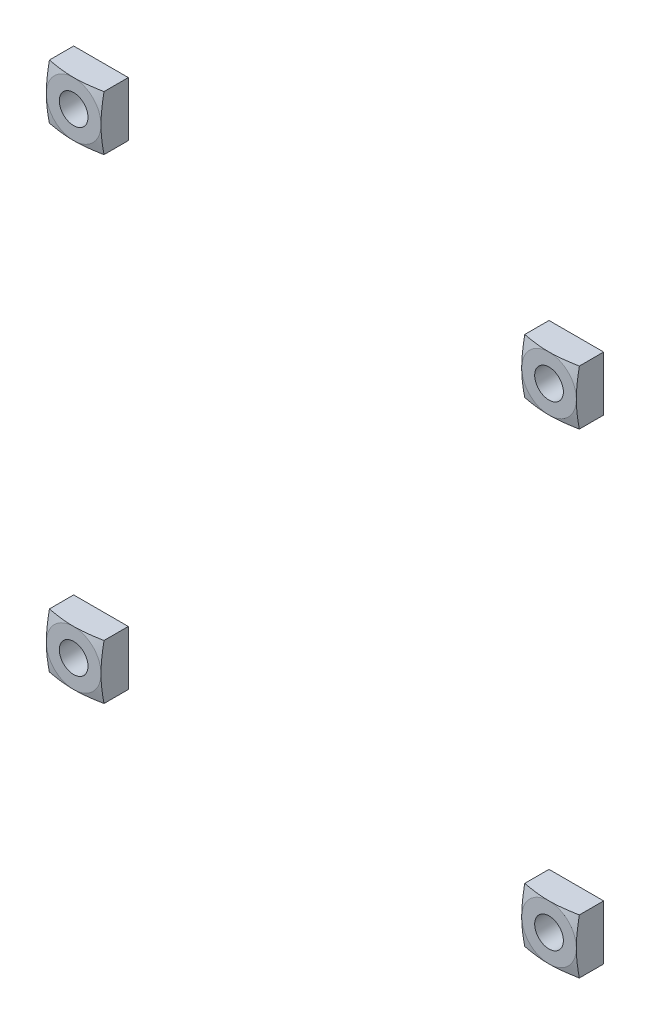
ISO-10303-21;
HEADER;
FILE_DESCRIPTION(('STEP AP214'),'2;1');
FILE_NAME('part.step','',(''),(''),'','','');
FILE_SCHEMA(('AUTOMOTIVE_DESIGN { 1 0 10303 214 1 1 1 1 }'));
ENDSEC;
DATA;
#1=APPLICATION_CONTEXT('core data for automotive mechanical design processes');
#2=APPLICATION_PROTOCOL_DEFINITION('international standard','automotive_design',2000,#1);
#3=PRODUCT_CONTEXT('',#1,'mechanical');
#4=PRODUCT('Part','Part','',(#3));
#5=PRODUCT_RELATED_PRODUCT_CATEGORY('part','',(#4));
#6=PRODUCT_DEFINITION_FORMATION('','',#4);
#7=PRODUCT_DEFINITION_CONTEXT('part definition',#1,'design');
#8=PRODUCT_DEFINITION('design','',#6,#7);
#9=PRODUCT_DEFINITION_SHAPE('','',#8);
#10=(LENGTH_UNIT() NAMED_UNIT(*) SI_UNIT(.MILLI.,.METRE.));
#11=(NAMED_UNIT(*) PLANE_ANGLE_UNIT() SI_UNIT($,.RADIAN.));
#12=(NAMED_UNIT(*) SI_UNIT($,.STERADIAN.) SOLID_ANGLE_UNIT());
#13=UNCERTAINTY_MEASURE_WITH_UNIT(LENGTH_MEASURE(1.E-05),#10,'distance_accuracy_value','');
#14=(GEOMETRIC_REPRESENTATION_CONTEXT(3) GLOBAL_UNCERTAINTY_ASSIGNED_CONTEXT((#13)) GLOBAL_UNIT_ASSIGNED_CONTEXT((#10,
#11,#12)) REPRESENTATION_CONTEXT('',''));
#15=CARTESIAN_POINT('',(0.,0.,0.));
#16=DIRECTION('',(0.,0.,1.));
#17=DIRECTION('',(1.,0.,0.));
#18=AXIS2_PLACEMENT_3D('',#15,#16,#17);
#19=CARTESIAN_POINT('',(-38.7984924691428,42.4307075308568,16.9672));
#20=DIRECTION('',(0.,-1.,0.));
#21=DIRECTION('',(1.,0.,0.));
#22=AXIS2_PLACEMENT_3D('',#19,#20,#21);
#23=PLANE('',#22);
#24=DIRECTION('',(0.,0.,1.));
#25=VECTOR('',#24,1.);
#26=CARTESIAN_POINT('',(-30.7984924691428,42.4307075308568,16.9672));
#27=LINE('',#26,#25);
#28=CARTESIAN_POINT('',(-30.7984924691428,42.4307075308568,16.9672));
#29=VERTEX_POINT('',#28);
#30=CARTESIAN_POINT('',(-30.7984924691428,42.4307075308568,20.5232472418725));
#31=VERTEX_POINT('',#30);
#32=EDGE_CURVE('P0_E153',#29,#31,#27,.T.);
#33=ORIENTED_EDGE('',*,*,#32,.T.);
#34=CARTESIAN_POINT('',(-42.8707092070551,42.4307075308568,19.6250632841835));
#35=CARTESIAN_POINT('',(-42.6623815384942,42.4307075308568,19.6750723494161));
#36=CARTESIAN_POINT('',(-42.4539699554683,42.4307075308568,19.7247354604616));
#37=CARTESIAN_POINT('',(-42.0369357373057,42.4307075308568,19.8231819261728));
#38=CARTESIAN_POINT('',(-41.8283130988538,42.4307075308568,19.8719652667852));
#39=CARTESIAN_POINT('',(-41.4108708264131,42.4307075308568,19.968451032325));
#40=CARTESIAN_POINT('',(-41.2020512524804,42.4307075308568,20.0161537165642));
#41=CARTESIAN_POINT('',(-40.7841132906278,42.4307075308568,20.1102317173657));
#42=CARTESIAN_POINT('',(-40.5749949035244,42.4307075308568,20.1566070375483));
#43=CARTESIAN_POINT('',(-40.1574835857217,42.4307075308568,20.2474599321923));
#44=CARTESIAN_POINT('',(-39.9490925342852,42.4307075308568,20.2919461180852));
#45=CARTESIAN_POINT('',(-39.5318784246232,42.4307075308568,20.3788421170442));
#46=CARTESIAN_POINT('',(-39.3230553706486,42.4307075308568,20.4212519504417));
#47=CARTESIAN_POINT('',(-38.9047594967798,42.4307075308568,20.5034540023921));
#48=CARTESIAN_POINT('',(-38.6952863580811,42.4307075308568,20.5432446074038));
#49=CARTESIAN_POINT('',(-38.2757191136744,42.4307075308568,20.6194398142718));
#50=CARTESIAN_POINT('',(-38.0656250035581,42.4307075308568,20.6558443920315));
#51=CARTESIAN_POINT('',(-37.6420838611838,42.4307075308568,20.7247518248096));
#52=CARTESIAN_POINT('',(-37.4286278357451,42.4307075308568,20.7571999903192));
#53=CARTESIAN_POINT('',(-37.0009230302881,42.4307075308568,20.8164547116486));
#54=CARTESIAN_POINT('',(-36.7866742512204,42.4307075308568,20.8432612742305));
#55=CARTESIAN_POINT('',(-36.3576823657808,42.4307075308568,20.8898500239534));
#56=CARTESIAN_POINT('',(-36.1429402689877,42.4307075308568,20.9096413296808));
#57=CARTESIAN_POINT('',(-35.7128484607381,42.4307075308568,20.9409514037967));
#58=CARTESIAN_POINT('',(-35.4974987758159,42.4307075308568,20.9524705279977));
#59=CARTESIAN_POINT('',(-35.0656219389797,42.4307075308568,20.9663542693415));
#60=CARTESIAN_POINT('',(-34.8490935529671,42.4307075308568,20.9686815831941));
#61=CARTESIAN_POINT('',(-34.4161434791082,42.4307075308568,20.9638761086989));
#62=CARTESIAN_POINT('',(-34.1997217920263,42.4307075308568,20.9567432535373));
#63=CARTESIAN_POINT('',(-33.7671012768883,42.4307075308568,20.9336058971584));
#64=CARTESIAN_POINT('',(-33.5509030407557,42.4307075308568,20.9175906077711));
#65=CARTESIAN_POINT('',(-33.1192313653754,42.4307075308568,20.8778523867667));
#66=CARTESIAN_POINT('',(-32.9037579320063,42.4307075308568,20.8541293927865));
#67=CARTESIAN_POINT('',(-32.3783678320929,42.4307075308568,20.7884609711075));
#68=CARTESIAN_POINT('',(-32.0688831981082,42.4307075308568,20.7430981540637));
#69=CARTESIAN_POINT('',(-31.4514114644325,42.4307075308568,20.6430238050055));
#70=CARTESIAN_POINT('',(-31.1434246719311,42.4307075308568,20.5883104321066));
#71=CARTESIAN_POINT('',(-30.5284950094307,42.4307075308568,20.4723484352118));
#72=CARTESIAN_POINT('',(-30.2215529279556,42.4307075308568,20.4110956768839));
#73=CARTESIAN_POINT('',(-29.6086441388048,42.4307075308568,20.2840443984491));
#74=CARTESIAN_POINT('',(-29.3026773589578,42.4307075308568,20.2182462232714));
#75=CARTESIAN_POINT('',(-28.6907794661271,42.4307075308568,20.0832616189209));
#76=CARTESIAN_POINT('',(-28.384849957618,42.4307075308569,20.0140679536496));
#77=CARTESIAN_POINT('',(-27.7735325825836,42.4307075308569,19.8733164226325));
#78=CARTESIAN_POINT('',(-27.4681447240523,42.4307075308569,19.8017585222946));
#79=CARTESIAN_POINT('',(-26.8579038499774,42.4307075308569,19.656916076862));
#80=CARTESIAN_POINT('',(-26.5530506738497,42.4307075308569,19.5836322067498));
#81=CARTESIAN_POINT('',(-25.9436676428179,42.4307075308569,19.4357309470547));
#82=CARTESIAN_POINT('',(-25.6391377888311,42.4307075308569,19.3611135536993));
#83=CARTESIAN_POINT('',(-24.7299459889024,42.4307075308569,19.1367260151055));
#84=CARTESIAN_POINT('',(-24.125654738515,42.4307075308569,18.9854550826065));
#85=CARTESIAN_POINT('',(-22.917638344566,42.4307075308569,18.6803792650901));
#86=CARTESIAN_POINT('',(-22.3139132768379,42.4307075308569,18.5265740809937));
#87=CARTESIAN_POINT('',(-21.109749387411,42.4307075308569,18.2180127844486));
#88=CARTESIAN_POINT('',(-20.5093085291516,42.4307075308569,18.0632646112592));
#89=CARTESIAN_POINT('',(-19.3088144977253,42.4307075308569,17.7525877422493));
#90=CARTESIAN_POINT('',(-18.7087612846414,42.4307075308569,17.5966592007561));
#91=CARTESIAN_POINT('',(-18.1088048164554,42.4307075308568,17.4403635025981));
#92=B_SPLINE_CURVE_WITH_KNOTS('',3,(#34,#35,#36,#37,#38,#39,#40,#41,#42,#43,#44,#45,#46,#47,#48,
#49,#50,#51,#52,#53,#54,#55,#56,#57,#58,#59,#60,#61,#62,#63,#64,#65,#66,#67,#68,#69,#70,#71,#72,
#73,#74,#75,#76,#77,#78,#79,#80,#81,#82,#83,#84,#85,#86,#87,#88,#89,#90,#91),.UNSPECIFIED.,.F.,
.F.,(4,2,2,2,2,2,2,2,2,2,2,2,2,2,2,2,2,2,2,2,2,2,2,2,2,2,2,2,4),(0.,0.642738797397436,
1.2854878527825,1.92808100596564,2.57067240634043,3.20992362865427,3.84916859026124,
4.4888037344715,5.12844343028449,5.77610915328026,6.42377409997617,7.07059408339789,
7.71738624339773,8.36680061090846,9.01621956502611,9.66642900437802,10.3166437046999,
11.254795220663,12.1931316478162,13.1320648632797,14.0709269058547,15.0118848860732,
15.9528566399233,16.8934663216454,17.8340786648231,19.7028801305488,21.5719037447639,
23.4320866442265,25.2920303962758),.UNSPECIFIED.);
#93=CARTESIAN_POINT('',(-34.7984924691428,42.4307075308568,20.9672));
#94=VERTEX_POINT('',#93);
#95=EDGE_CURVE('P0_E95',#31,#94,#92,.F.);
#96=ORIENTED_EDGE('',*,*,#95,.T.);
#97=CARTESIAN_POINT('',(-38.7984924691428,42.4307075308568,20.5232472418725));
#98=VERTEX_POINT('',#97);
#99=EDGE_CURVE('P0_E85',#94,#98,#92,.F.);
#100=ORIENTED_EDGE('',*,*,#99,.T.);
#101=DIRECTION('',(0.,0.,1.));
#102=VECTOR('',#101,1.);
#103=CARTESIAN_POINT('',(-38.7984924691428,42.4307075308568,16.9672));
#104=LINE('',#103,#102);
#105=CARTESIAN_POINT('',(-38.7984924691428,42.4307075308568,16.9672));
#106=VERTEX_POINT('',#105);
#107=EDGE_CURVE('P0_E89',#106,#98,#104,.T.);
#108=ORIENTED_EDGE('',*,*,#107,.F.);
#109=DIRECTION('',(1.,0.,0.));
#110=VECTOR('',#109,1.);
#111=CARTESIAN_POINT('',(-38.7984924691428,42.4307075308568,16.9672));
#112=LINE('',#111,#110);
#113=EDGE_CURVE('P0_E155',#106,#29,#112,.T.);
#114=ORIENTED_EDGE('',*,*,#113,.T.);
#115=EDGE_LOOP('',(#33,#96,#100,#108,#114));
#116=FACE_BOUND('',#115,.T.);
#117=ADVANCED_FACE('P0_F16',(#116),#23,.T.);
#118=CARTESIAN_POINT('',(-38.7984924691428,50.4307075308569,16.9672));
#119=DIRECTION('',(-1.,0.,0.));
#120=DIRECTION('',(0.,-1.,0.));
#121=AXIS2_PLACEMENT_3D('',#118,#119,#120);
#122=PLANE('',#121);
#123=ORIENTED_EDGE('',*,*,#107,.T.);
#124=CARTESIAN_POINT('',(-38.7984924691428,38.3584907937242,19.6250632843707));
#125=CARTESIAN_POINT('',(-38.7984924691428,38.566818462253,19.6750723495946));
#126=CARTESIAN_POINT('',(-38.7984924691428,38.7752300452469,19.7247354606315));
#127=CARTESIAN_POINT('',(-38.7984924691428,39.1922642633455,19.8231819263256));
#128=CARTESIAN_POINT('',(-38.7984924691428,39.4008869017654,19.8719652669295));
#129=CARTESIAN_POINT('',(-38.7984924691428,39.8183291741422,19.9684510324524));
#130=CARTESIAN_POINT('',(-38.7984924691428,40.0271487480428,20.0161537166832));
#131=CARTESIAN_POINT('',(-38.7984924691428,40.4450867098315,20.1102317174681));
#132=CARTESIAN_POINT('',(-38.7984924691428,40.6542050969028,20.1566070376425));
#133=CARTESIAN_POINT('',(-38.7984924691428,41.0717164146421,20.2474599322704));
#134=CARTESIAN_POINT('',(-38.7984924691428,41.2801074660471,20.2919461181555));
#135=CARTESIAN_POINT('',(-38.7984924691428,41.6973215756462,20.3788421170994));
#136=CARTESIAN_POINT('',(-38.7984924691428,41.9061446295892,20.4212519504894));
#137=CARTESIAN_POINT('',(-38.7984924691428,42.3244405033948,20.5034540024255));
#138=CARTESIAN_POINT('',(-38.7984924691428,42.5339136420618,20.5432446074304));
#139=CARTESIAN_POINT('',(-38.7984924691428,42.9534808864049,20.6194398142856));
#140=CARTESIAN_POINT('',(-38.7984924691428,43.1635749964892,20.6558443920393));
#141=CARTESIAN_POINT('',(-38.7984924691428,43.5871161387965,20.7247518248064));
#142=CARTESIAN_POINT('',(-38.7984924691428,43.8005721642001,20.7571999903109));
#143=CARTESIAN_POINT('',(-38.7984924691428,44.2282769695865,20.8164547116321));
#144=CARTESIAN_POINT('',(-38.7984924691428,44.4425257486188,20.8432612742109));
#145=CARTESIAN_POINT('',(-38.7984924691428,44.8715176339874,20.8898500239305));
#146=CARTESIAN_POINT('',(-38.7984924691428,45.0862597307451,20.9096413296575));
#147=CARTESIAN_POINT('',(-38.7984924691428,45.5163515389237,20.940951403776));
#148=CARTESIAN_POINT('',(-38.7984924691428,45.7317012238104,20.9524705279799));
#149=CARTESIAN_POINT('',(-38.7984924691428,46.1635780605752,20.966354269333));
#150=CARTESIAN_POINT('',(-38.7984924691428,46.3801064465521,20.968681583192));
#151=CARTESIAN_POINT('',(-38.7984924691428,46.8130565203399,20.9638761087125));
#152=CARTESIAN_POINT('',(-38.7984924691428,47.0294782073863,20.9567432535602));
#153=CARTESIAN_POINT('',(-38.7984924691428,47.4620987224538,20.933605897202));
#154=CARTESIAN_POINT('',(-38.7984924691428,47.6782969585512,20.9175906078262));
#155=CARTESIAN_POINT('',(-38.7984924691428,48.1099686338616,20.8778523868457));
#156=CARTESIAN_POINT('',(-38.7984924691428,48.3254420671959,20.8541293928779));
#157=CARTESIAN_POINT('',(-38.7984924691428,48.8508321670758,20.7884609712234));
#158=CARTESIAN_POINT('',(-38.7984924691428,49.1603168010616,20.7430981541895));
#159=CARTESIAN_POINT('',(-38.7984924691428,49.7777885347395,20.6430238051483));
#160=CARTESIAN_POINT('',(-38.7984924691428,50.0857753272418,20.5883104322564));
#161=CARTESIAN_POINT('',(-38.7984924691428,50.7007049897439,20.4723484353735));
#162=CARTESIAN_POINT('',(-38.7984924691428,51.0076470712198,20.4110956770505));
#163=CARTESIAN_POINT('',(-38.7984924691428,51.6205558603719,20.284044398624));
#164=CARTESIAN_POINT('',(-38.7984924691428,51.9265226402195,20.2182462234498));
#165=CARTESIAN_POINT('',(-38.7984924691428,52.5384205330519,20.083261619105));
#166=CARTESIAN_POINT('',(-38.7984924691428,52.8443500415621,20.0140679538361));
#167=CARTESIAN_POINT('',(-38.7984924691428,53.4556674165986,19.873316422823));
#168=CARTESIAN_POINT('',(-38.7984924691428,53.7610552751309,19.8017585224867));
#169=CARTESIAN_POINT('',(-38.7984924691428,54.3712961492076,19.656916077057));
#170=CARTESIAN_POINT('',(-38.7984924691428,54.6761493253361,19.5836322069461));
#171=CARTESIAN_POINT('',(-38.7984924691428,55.2855323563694,19.4357309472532));
#172=CARTESIAN_POINT('',(-38.7984924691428,55.5900622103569,19.3611135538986));
#173=CARTESIAN_POINT('',(-38.7984924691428,56.499254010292,19.1367260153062));
#174=CARTESIAN_POINT('',(-38.7984924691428,57.1035452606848,18.9854550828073));
#175=CARTESIAN_POINT('',(-38.7984924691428,58.3115616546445,18.6803792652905));
#176=CARTESIAN_POINT('',(-38.7984924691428,58.9152867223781,18.5265740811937));
#177=CARTESIAN_POINT('',(-38.7984924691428,60.1194506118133,18.2180127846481));
#178=CARTESIAN_POINT('',(-38.7984924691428,60.7198914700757,18.0632646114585));
#179=CARTESIAN_POINT('',(-38.7984924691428,61.9203855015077,17.7525877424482));
#180=CARTESIAN_POINT('',(-38.7984924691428,62.5204387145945,17.5966592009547));
#181=CARTESIAN_POINT('',(-38.7984924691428,63.1203951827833,17.4403635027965));
#182=B_SPLINE_CURVE_WITH_KNOTS('',3,(#124,#125,#126,#127,#128,#129,#130,#131,#132,#133,#134,
#135,#136,#137,#138,#139,#140,#141,#142,#143,#144,#145,#146,#147,#148,#149,#150,#151,#152,#153,
#154,#155,#156,#157,#158,#159,#160,#161,#162,#163,#164,#165,#166,#167,#168,#169,#170,#171,#172,
#173,#174,#175,#176,#177,#178,#179,#180,#181),.UNSPECIFIED.,.F.,.F.,(4,2,2,2,2,2,2,2,2,2,2,2,2,
2,2,2,2,2,2,2,2,2,2,2,2,2,2,2,4),(0.,0.642738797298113,1.28548785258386,1.92808100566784,
2.57067240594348,3.20992362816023,3.84916858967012,4.48880373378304,5.1284434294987,
5.77610915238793,6.42377409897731,7.07059408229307,7.71738624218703,8.36680060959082,
9.0162195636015,9.66642900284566,10.3166437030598,11.2547952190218,12.193131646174,
13.132064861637,14.0709269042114,15.0118848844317,15.9528566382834,16.893466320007,
17.8340786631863,19.7028801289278,21.5719037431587,23.4320866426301,25.2920303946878),.UNSPECIFIED.);
#183=CARTESIAN_POINT('',(-38.7984924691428,46.4307075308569,20.9672));
#184=VERTEX_POINT('',#183);
#185=EDGE_CURVE('P0_E78',#98,#184,#182,.T.);
#186=ORIENTED_EDGE('',*,*,#185,.T.);
#187=CARTESIAN_POINT('',(-38.7984924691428,50.4307075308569,20.5232472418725));
#188=VERTEX_POINT('',#187);
#189=EDGE_CURVE('P0_E68',#184,#188,#182,.T.);
#190=ORIENTED_EDGE('',*,*,#189,.T.);
#191=DIRECTION('',(0.,0.,1.));
#192=VECTOR('',#191,1.);
#193=CARTESIAN_POINT('',(-38.7984924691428,50.4307075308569,16.9672));
#194=LINE('',#193,#192);
#195=CARTESIAN_POINT('',(-38.7984924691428,50.4307075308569,16.9672));
#196=VERTEX_POINT('',#195);
#197=EDGE_CURVE('P0_E161',#196,#188,#194,.T.);
#198=ORIENTED_EDGE('',*,*,#197,.F.);
#199=DIRECTION('',(0.,-1.,0.));
#200=VECTOR('',#199,1.);
#201=CARTESIAN_POINT('',(-38.7984924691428,50.4307075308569,16.9672));
#202=LINE('',#201,#200);
#203=EDGE_CURVE('P0_E159',#196,#106,#202,.T.);
#204=ORIENTED_EDGE('',*,*,#203,.T.);
#205=EDGE_LOOP('',(#123,#186,#190,#198,#204));
#206=FACE_BOUND('',#205,.T.);
#207=ADVANCED_FACE('P0_F93',(#206),#122,.T.);
#208=CARTESIAN_POINT('',(-30.7984924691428,50.4307075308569,16.9672));
#209=DIRECTION('',(0.,1.,0.));
#210=DIRECTION('',(-1.,0.,0.));
#211=AXIS2_PLACEMENT_3D('',#208,#209,#210);
#212=PLANE('',#211);
#213=ORIENTED_EDGE('',*,*,#197,.T.);
#214=CARTESIAN_POINT('',(-42.8707092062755,50.4307075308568,19.6250632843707));
#215=CARTESIAN_POINT('',(-42.6623815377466,50.4307075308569,19.6750723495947));
#216=CARTESIAN_POINT('',(-42.4539699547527,50.4307075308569,19.7247354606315));
#217=CARTESIAN_POINT('',(-42.0369357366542,50.4307075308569,19.8231819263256));
#218=CARTESIAN_POINT('',(-41.8283130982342,50.4307075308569,19.8719652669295));
#219=CARTESIAN_POINT('',(-41.4108708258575,50.4307075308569,19.9684510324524));
#220=CARTESIAN_POINT('',(-41.2020512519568,50.4307075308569,20.0161537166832));
#221=CARTESIAN_POINT('',(-40.7841132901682,50.4307075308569,20.1102317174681));
#222=CARTESIAN_POINT('',(-40.5749949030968,50.4307075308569,20.1566070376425));
#223=CARTESIAN_POINT('',(-40.1574835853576,50.4307075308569,20.2474599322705));
#224=CARTESIAN_POINT('',(-39.9490925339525,50.4307075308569,20.2919461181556));
#225=CARTESIAN_POINT('',(-39.5318784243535,50.4307075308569,20.3788421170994));
#226=CARTESIAN_POINT('',(-39.3230553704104,50.4307075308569,20.4212519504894));
#227=CARTESIAN_POINT('',(-38.9047594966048,50.4307075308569,20.5034540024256));
#228=CARTESIAN_POINT('',(-38.6952863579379,50.4307075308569,20.5432446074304));
#229=CARTESIAN_POINT('',(-38.2757191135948,50.4307075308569,20.6194398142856));
#230=CARTESIAN_POINT('',(-38.0656250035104,50.4307075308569,20.6558443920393));
#231=CARTESIAN_POINT('',(-37.6420838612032,50.4307075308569,20.7247518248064));
#232=CARTESIAN_POINT('',(-37.4286278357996,50.4307075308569,20.7571999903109));
#233=CARTESIAN_POINT('',(-37.0009230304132,50.4307075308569,20.8164547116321));
#234=CARTESIAN_POINT('',(-36.7866742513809,50.4307075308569,20.8432612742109));
#235=CARTESIAN_POINT('',(-36.3576823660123,50.4307075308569,20.8898500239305));
#236=CARTESIAN_POINT('',(-36.1429402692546,50.4307075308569,20.9096413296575));
#237=CARTESIAN_POINT('',(-35.7128484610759,50.4307075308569,20.940951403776));
#238=CARTESIAN_POINT('',(-35.4974987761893,50.4307075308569,20.9524705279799));
#239=CARTESIAN_POINT('',(-35.0656219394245,50.4307075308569,20.966354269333));
#240=CARTESIAN_POINT('',(-34.8490935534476,50.4307075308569,20.968681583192));
#241=CARTESIAN_POINT('',(-34.4161434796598,50.4307075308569,20.9638761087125));
#242=CARTESIAN_POINT('',(-34.1997217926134,50.4307075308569,20.9567432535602));
#243=CARTESIAN_POINT('',(-33.7671012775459,50.4307075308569,20.933605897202));
#244=CARTESIAN_POINT('',(-33.5509030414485,50.4307075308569,20.9175906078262));
#245=CARTESIAN_POINT('',(-33.1192313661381,50.4307075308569,20.8778523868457));
#246=CARTESIAN_POINT('',(-32.9037579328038,50.4307075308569,20.8541293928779));
#247=CARTESIAN_POINT('',(-32.3783678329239,50.4307075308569,20.7884609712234));
#248=CARTESIAN_POINT('',(-32.0688831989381,50.4307075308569,20.7430981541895));
#249=CARTESIAN_POINT('',(-31.4514114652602,50.4307075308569,20.6430238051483));
#250=CARTESIAN_POINT('',(-31.1434246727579,50.4307075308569,20.5883104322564));
#251=CARTESIAN_POINT('',(-30.5284950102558,50.4307075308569,20.4723484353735));
#252=CARTESIAN_POINT('',(-30.2215529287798,50.4307075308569,20.4110956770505));
#253=CARTESIAN_POINT('',(-29.6086441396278,50.4307075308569,20.284044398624));
#254=CARTESIAN_POINT('',(-29.3026773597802,50.4307075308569,20.2182462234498));
#255=CARTESIAN_POINT('',(-28.6907794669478,50.4307075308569,20.083261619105));
#256=CARTESIAN_POINT('',(-28.3848499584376,50.4307075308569,20.0140679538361));
#257=CARTESIAN_POINT('',(-27.7735325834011,50.4307075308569,19.873316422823));
#258=CARTESIAN_POINT('',(-27.4681447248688,50.4307075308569,19.8017585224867));
#259=CARTESIAN_POINT('',(-26.8579038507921,50.4307075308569,19.656916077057));
#260=CARTESIAN_POINT('',(-26.5530506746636,50.4307075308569,19.5836322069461));
#261=CARTESIAN_POINT('',(-25.9436676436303,50.4307075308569,19.4357309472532));
#262=CARTESIAN_POINT('',(-25.6391377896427,50.4307075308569,19.3611135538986));
#263=CARTESIAN_POINT('',(-24.7299459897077,50.4307075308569,19.1367260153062));
#264=CARTESIAN_POINT('',(-24.1256547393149,50.4307075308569,18.9854550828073));
#265=CARTESIAN_POINT('',(-22.9176383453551,50.4307075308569,18.6803792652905));
#266=CARTESIAN_POINT('',(-22.3139132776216,50.4307075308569,18.5265740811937));
#267=CARTESIAN_POINT('',(-21.1097493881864,50.4307075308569,18.2180127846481));
#268=CARTESIAN_POINT('',(-20.509308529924,50.4307075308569,18.0632646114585));
#269=CARTESIAN_POINT('',(-19.308814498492,50.4307075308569,17.7525877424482));
#270=CARTESIAN_POINT('',(-18.7087612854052,50.4307075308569,17.5966592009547));
#271=CARTESIAN_POINT('',(-18.1088048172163,50.4307075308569,17.4403635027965));
#272=B_SPLINE_CURVE_WITH_KNOTS('',3,(#214,#215,#216,#217,#218,#219,#220,#221,#222,#223,#224,
#225,#226,#227,#228,#229,#230,#231,#232,#233,#234,#235,#236,#237,#238,#239,#240,#241,#242,#243,
#244,#245,#246,#247,#248,#249,#250,#251,#252,#253,#254,#255,#256,#257,#258,#259,#260,#261,#262,
#263,#264,#265,#266,#267,#268,#269,#270,#271),.UNSPECIFIED.,.F.,.F.,(4,2,2,2,2,2,2,2,2,2,2,2,2,
2,2,2,2,2,2,2,2,2,2,2,2,2,2,2,4),(0.,0.64273879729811,1.28548785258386,1.92808100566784,
2.57067240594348,3.20992362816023,3.84916858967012,4.48880373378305,5.1284434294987,
5.77610915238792,6.42377409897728,7.07059408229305,7.717386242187,8.36680060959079,
9.01621956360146,9.66642900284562,10.3166437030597,11.2547952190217,12.193131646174,
13.1320648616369,14.0709269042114,15.0118848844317,15.9528566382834,16.893466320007,
17.8340786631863,19.7028801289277,21.5719037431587,23.4320866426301,25.2920303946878),.UNSPECIFIED.);
#273=CARTESIAN_POINT('',(-34.7984924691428,50.4307075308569,20.9672));
#274=VERTEX_POINT('',#273);
#275=EDGE_CURVE('P0_E74',#188,#274,#272,.T.);
#276=ORIENTED_EDGE('',*,*,#275,.T.);
#277=CARTESIAN_POINT('',(-30.7984924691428,50.4307075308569,20.5232472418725));
#278=VERTEX_POINT('',#277);
#279=EDGE_CURVE('P0_E32',#274,#278,#272,.T.);
#280=ORIENTED_EDGE('',*,*,#279,.T.);
#281=DIRECTION('',(0.,0.,1.));
#282=VECTOR('',#281,1.);
#283=CARTESIAN_POINT('',(-30.7984924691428,50.4307075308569,16.9672));
#284=LINE('',#283,#282);
#285=CARTESIAN_POINT('',(-30.7984924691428,50.4307075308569,16.9672));
#286=VERTEX_POINT('',#285);
#287=EDGE_CURVE('P0_E158',#286,#278,#284,.T.);
#288=ORIENTED_EDGE('',*,*,#287,.F.);
#289=DIRECTION('',(-1.,0.,0.));
#290=VECTOR('',#289,1.);
#291=CARTESIAN_POINT('',(-30.7984924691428,50.4307075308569,16.9672));
#292=LINE('',#291,#290);
#293=EDGE_CURVE('P0_E163',#286,#196,#292,.T.);
#294=ORIENTED_EDGE('',*,*,#293,.T.);
#295=EDGE_LOOP('',(#213,#276,#280,#288,#294));
#296=FACE_BOUND('',#295,.T.);
#297=ADVANCED_FACE('P0_F136',(#296),#212,.T.);
#298=CARTESIAN_POINT('',(-30.7984924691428,42.4307075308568,16.9672));
#299=DIRECTION('',(1.,0.,0.));
#300=DIRECTION('',(0.,1.,0.));
#301=AXIS2_PLACEMENT_3D('',#298,#299,#300);
#302=PLANE('',#301);
#303=ORIENTED_EDGE('',*,*,#287,.T.);
#304=CARTESIAN_POINT('',(-30.7984924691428,38.3584907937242,19.6250632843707));
#305=CARTESIAN_POINT('',(-30.7984924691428,38.566818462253,19.6750723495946));
#306=CARTESIAN_POINT('',(-30.7984924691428,38.7752300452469,19.7247354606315));
#307=CARTESIAN_POINT('',(-30.7984924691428,39.1922642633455,19.8231819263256));
#308=CARTESIAN_POINT('',(-30.7984924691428,39.4008869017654,19.8719652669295));
#309=CARTESIAN_POINT('',(-30.7984924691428,39.8183291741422,19.9684510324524));
#310=CARTESIAN_POINT('',(-30.7984924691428,40.0271487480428,20.0161537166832));
#311=CARTESIAN_POINT('',(-30.7984924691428,40.4450867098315,20.1102317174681));
#312=CARTESIAN_POINT('',(-30.7984924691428,40.6542050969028,20.1566070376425));
#313=CARTESIAN_POINT('',(-30.7984924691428,41.0717164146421,20.2474599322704));
#314=CARTESIAN_POINT('',(-30.7984924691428,41.2801074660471,20.2919461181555));
#315=CARTESIAN_POINT('',(-30.7984924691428,41.6973215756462,20.3788421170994));
#316=CARTESIAN_POINT('',(-30.7984924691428,41.9061446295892,20.4212519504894));
#317=CARTESIAN_POINT('',(-30.7984924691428,42.3244405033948,20.5034540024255));
#318=CARTESIAN_POINT('',(-30.7984924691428,42.5339136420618,20.5432446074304));
#319=CARTESIAN_POINT('',(-30.7984924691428,42.9534808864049,20.6194398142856));
#320=CARTESIAN_POINT('',(-30.7984924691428,43.1635749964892,20.6558443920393));
#321=CARTESIAN_POINT('',(-30.7984924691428,43.5871161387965,20.7247518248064));
#322=CARTESIAN_POINT('',(-30.7984924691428,43.8005721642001,20.7571999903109));
#323=CARTESIAN_POINT('',(-30.7984924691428,44.2282769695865,20.8164547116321));
#324=CARTESIAN_POINT('',(-30.7984924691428,44.4425257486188,20.8432612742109));
#325=CARTESIAN_POINT('',(-30.7984924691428,44.8715176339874,20.8898500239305));
#326=CARTESIAN_POINT('',(-30.7984924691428,45.0862597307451,20.9096413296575));
#327=CARTESIAN_POINT('',(-30.7984924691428,45.5163515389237,20.940951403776));
#328=CARTESIAN_POINT('',(-30.7984924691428,45.7317012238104,20.9524705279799));
#329=CARTESIAN_POINT('',(-30.7984924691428,46.1635780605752,20.966354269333));
#330=CARTESIAN_POINT('',(-30.7984924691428,46.3801064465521,20.968681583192));
#331=CARTESIAN_POINT('',(-30.7984924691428,46.8130565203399,20.9638761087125));
#332=CARTESIAN_POINT('',(-30.7984924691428,47.0294782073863,20.9567432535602));
#333=CARTESIAN_POINT('',(-30.7984924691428,47.4620987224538,20.933605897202));
#334=CARTESIAN_POINT('',(-30.7984924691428,47.6782969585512,20.9175906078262));
#335=CARTESIAN_POINT('',(-30.7984924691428,48.1099686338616,20.8778523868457));
#336=CARTESIAN_POINT('',(-30.7984924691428,48.3254420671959,20.8541293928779));
#337=CARTESIAN_POINT('',(-30.7984924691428,48.8508321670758,20.7884609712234));
#338=CARTESIAN_POINT('',(-30.7984924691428,49.1603168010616,20.7430981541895));
#339=CARTESIAN_POINT('',(-30.7984924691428,49.7777885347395,20.6430238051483));
#340=CARTESIAN_POINT('',(-30.7984924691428,50.0857753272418,20.5883104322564));
#341=CARTESIAN_POINT('',(-30.7984924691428,50.7007049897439,20.4723484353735));
#342=CARTESIAN_POINT('',(-30.7984924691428,51.0076470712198,20.4110956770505));
#343=CARTESIAN_POINT('',(-30.7984924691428,51.6205558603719,20.284044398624));
#344=CARTESIAN_POINT('',(-30.7984924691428,51.9265226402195,20.2182462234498));
#345=CARTESIAN_POINT('',(-30.7984924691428,52.5384205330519,20.083261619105));
#346=CARTESIAN_POINT('',(-30.7984924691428,52.8443500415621,20.0140679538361));
#347=CARTESIAN_POINT('',(-30.7984924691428,53.4556674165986,19.873316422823));
#348=CARTESIAN_POINT('',(-30.7984924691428,53.7610552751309,19.8017585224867));
#349=CARTESIAN_POINT('',(-30.7984924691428,54.3712961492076,19.656916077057));
#350=CARTESIAN_POINT('',(-30.7984924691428,54.6761493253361,19.5836322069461));
#351=CARTESIAN_POINT('',(-30.7984924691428,55.2855323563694,19.4357309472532));
#352=CARTESIAN_POINT('',(-30.7984924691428,55.5900622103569,19.3611135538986));
#353=CARTESIAN_POINT('',(-30.7984924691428,56.499254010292,19.1367260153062));
#354=CARTESIAN_POINT('',(-30.7984924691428,57.1035452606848,18.9854550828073));
#355=CARTESIAN_POINT('',(-30.7984924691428,58.3115616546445,18.6803792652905));
#356=CARTESIAN_POINT('',(-30.7984924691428,58.9152867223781,18.5265740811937));
#357=CARTESIAN_POINT('',(-30.7984924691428,60.1194506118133,18.2180127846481));
#358=CARTESIAN_POINT('',(-30.7984924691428,60.7198914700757,18.0632646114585));
#359=CARTESIAN_POINT('',(-30.7984924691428,61.9203855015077,17.7525877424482));
#360=CARTESIAN_POINT('',(-30.7984924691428,62.5204387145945,17.5966592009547));
#361=CARTESIAN_POINT('',(-30.7984924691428,63.1203951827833,17.4403635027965));
#362=B_SPLINE_CURVE_WITH_KNOTS('',3,(#304,#305,#306,#307,#308,#309,#310,#311,#312,#313,#314,
#315,#316,#317,#318,#319,#320,#321,#322,#323,#324,#325,#326,#327,#328,#329,#330,#331,#332,#333,
#334,#335,#336,#337,#338,#339,#340,#341,#342,#343,#344,#345,#346,#347,#348,#349,#350,#351,#352,
#353,#354,#355,#356,#357,#358,#359,#360,#361),.UNSPECIFIED.,.F.,.F.,(4,2,2,2,2,2,2,2,2,2,2,2,2,
2,2,2,2,2,2,2,2,2,2,2,2,2,2,2,4),(0.,0.642738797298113,1.28548785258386,1.92808100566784,
2.57067240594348,3.20992362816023,3.84916858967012,4.48880373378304,5.1284434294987,
5.77610915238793,6.42377409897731,7.07059408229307,7.71738624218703,8.36680060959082,
9.0162195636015,9.66642900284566,10.3166437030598,11.2547952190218,12.193131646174,
13.132064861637,14.0709269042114,15.0118848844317,15.9528566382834,16.893466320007,
17.8340786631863,19.7028801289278,21.5719037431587,23.4320866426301,25.2920303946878),.UNSPECIFIED.);
#363=CARTESIAN_POINT('',(-30.7984924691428,46.4307075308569,20.9672));
#364=VERTEX_POINT('',#363);
#365=EDGE_CURVE('P0_E132',#278,#364,#362,.F.);
#366=ORIENTED_EDGE('',*,*,#365,.T.);
#367=EDGE_CURVE('P0_E39',#364,#31,#362,.F.);
#368=ORIENTED_EDGE('',*,*,#367,.T.);
#369=ORIENTED_EDGE('',*,*,#32,.F.);
#370=DIRECTION('',(0.,1.,0.));
#371=VECTOR('',#370,1.);
#372=CARTESIAN_POINT('',(-30.7984924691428,42.4307075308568,16.9672));
#373=LINE('',#372,#371);
#374=EDGE_CURVE('P0_E170',#29,#286,#373,.T.);
#375=ORIENTED_EDGE('',*,*,#374,.T.);
#376=EDGE_LOOP('',(#303,#366,#368,#369,#375));
#377=FACE_BOUND('',#376,.T.);
#378=ADVANCED_FACE('P0_F133',(#377),#302,.T.);
#379=CARTESIAN_POINT('',(-38.7984924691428,42.4307075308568,20.9672));
#380=DIRECTION('',(0.,0.,-1.));
#381=DIRECTION('',(-1.,0.,0.));
#382=AXIS2_PLACEMENT_3D('',#379,#380,#381);
#383=PLANE('',#382);
#384=CARTESIAN_POINT('',(-34.7984924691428,46.4307075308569,20.9672));
#385=DIRECTION('',(0.,0.,1.));
#386=DIRECTION('',(1.,0.,0.));
#387=AXIS2_PLACEMENT_3D('',#384,#385,#386);
#388=CIRCLE('',#387,2.1);
#389=CARTESIAN_POINT('',(-32.6984924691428,46.4307075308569,20.9672));
#390=VERTEX_POINT('',#389);
#391=EDGE_CURVE('P0_E174',#390,#390,#388,.T.);
#392=ORIENTED_EDGE('',*,*,#391,.F.);
#393=EDGE_LOOP('',(#392));
#394=FACE_BOUND('',#393,.T.);
#395=CARTESIAN_POINT('',(-34.7984924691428,46.4307075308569,20.9672));
#396=DIRECTION('',(0.,0.,-1.));
#397=DIRECTION('',(-1.,0.,0.));
#398=AXIS2_PLACEMENT_3D('',#395,#396,#397);
#399=CIRCLE('',#398,4.);
#400=EDGE_CURVE('P0_E10',#184,#274,#399,.T.);
#401=ORIENTED_EDGE('',*,*,#400,.F.);
#402=EDGE_CURVE('P0_E20',#94,#184,#399,.T.);
#403=ORIENTED_EDGE('',*,*,#402,.F.);
#404=EDGE_CURVE('P0_E25',#364,#94,#399,.T.);
#405=ORIENTED_EDGE('',*,*,#404,.F.);
#406=CARTESIAN_POINT('',(-34.7984924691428,46.4307075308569,20.9672));
#407=DIRECTION('',(0.,0.,1.));
#408=DIRECTION('',(1.,0.,0.));
#409=AXIS2_PLACEMENT_3D('',#406,#407,#408);
#410=CIRCLE('',#409,4.);
#411=EDGE_CURVE('P0_E91',#364,#274,#410,.T.);
#412=ORIENTED_EDGE('',*,*,#411,.T.);
#413=EDGE_LOOP('',(#401,#403,#405,#412));
#414=FACE_BOUND('',#413,.T.);
#415=ADVANCED_FACE('P0_F90',(#394,#414),#383,.F.);
#416=CARTESIAN_POINT('',(-38.7984924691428,42.4307075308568,16.9672));
#417=DIRECTION('',(0.,0.,-1.));
#418=DIRECTION('',(-1.,0.,0.));
#419=AXIS2_PLACEMENT_3D('',#416,#417,#418);
#420=PLANE('',#419);
#421=CARTESIAN_POINT('',(-34.7984924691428,46.4307075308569,16.9672));
#422=DIRECTION('',(0.,0.,1.));
#423=DIRECTION('',(1.,0.,0.));
#424=AXIS2_PLACEMENT_3D('',#421,#422,#423);
#425=CIRCLE('',#424,2.1);
#426=CARTESIAN_POINT('',(-32.6984924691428,46.4307075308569,16.9672));
#427=VERTEX_POINT('',#426);
#428=EDGE_CURVE('P0_E173',#427,#427,#425,.T.);
#429=ORIENTED_EDGE('',*,*,#428,.T.);
#430=EDGE_LOOP('',(#429));
#431=FACE_BOUND('',#430,.T.);
#432=ORIENTED_EDGE('',*,*,#113,.F.);
#433=ORIENTED_EDGE('',*,*,#203,.F.);
#434=ORIENTED_EDGE('',*,*,#293,.F.);
#435=ORIENTED_EDGE('',*,*,#374,.F.);
#436=EDGE_LOOP('',(#432,#433,#434,#435));
#437=FACE_BOUND('',#436,.T.);
#438=ADVANCED_FACE('P0_F179',(#431,#437),#420,.T.);
#439=CARTESIAN_POINT('',(-34.7984924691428,46.4307075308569,16.9672));
#440=DIRECTION('',(0.,0.,1.));
#441=DIRECTION('',(1.,0.,0.));
#442=AXIS2_PLACEMENT_3D('',#439,#440,#441);
#443=CYLINDRICAL_SURFACE('',#442,2.1);
#444=ORIENTED_EDGE('',*,*,#428,.F.);
#445=EDGE_LOOP('',(#444));
#446=FACE_BOUND('',#445,.T.);
#447=ORIENTED_EDGE('',*,*,#391,.T.);
#448=EDGE_LOOP('',(#447));
#449=FACE_BOUND('',#448,.T.);
#450=ADVANCED_FACE('P0_F122',(#446,#449),#443,.F.);
#451=CARTESIAN_POINT('',(-34.7984924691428,46.4307075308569,20.9672));
#452=DIRECTION('',(0.,0.,-1.));
#453=DIRECTION('',(-1.,0.,0.));
#454=AXIS2_PLACEMENT_3D('',#451,#452,#453);
#455=CONICAL_SURFACE('',#454,4.,1.30899693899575);
#456=ORIENTED_EDGE('',*,*,#402,.T.);
#457=ORIENTED_EDGE('',*,*,#185,.F.);
#458=ORIENTED_EDGE('',*,*,#99,.F.);
#459=EDGE_LOOP('',(#456,#457,#458));
#460=FACE_BOUND('',#459,.T.);
#461=ADVANCED_FACE('P0_F83',(#460),#455,.T.);
#462=ORIENTED_EDGE('',*,*,#367,.F.);
#463=ORIENTED_EDGE('',*,*,#404,.T.);
#464=ORIENTED_EDGE('',*,*,#95,.F.);
#465=EDGE_LOOP('',(#462,#463,#464));
#466=FACE_BOUND('',#465,.T.);
#467=ADVANCED_FACE('P0_F121',(#466),#455,.T.);
#468=ORIENTED_EDGE('',*,*,#411,.F.);
#469=ORIENTED_EDGE('',*,*,#365,.F.);
#470=ORIENTED_EDGE('',*,*,#279,.F.);
#471=EDGE_LOOP('',(#468,#469,#470));
#472=FACE_BOUND('',#471,.T.);
#473=ADVANCED_FACE('P0_F117',(#472),#455,.T.);
#474=ORIENTED_EDGE('',*,*,#400,.T.);
#475=ORIENTED_EDGE('',*,*,#275,.F.);
#476=ORIENTED_EDGE('',*,*,#189,.F.);
#477=EDGE_LOOP('',(#474,#475,#476));
#478=FACE_BOUND('',#477,.T.);
#479=ADVANCED_FACE('P0_F70',(#478),#455,.T.);
#480=CLOSED_SHELL('',(#117,#207,#297,#378,#415,#438,#450,#461,#467,#473,#479));
#481=MANIFOLD_SOLID_BREP('P0_B1',#480);
#482=CARTESIAN_POINT('',(-38.7984924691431,112.027692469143,16.9672));
#483=DIRECTION('',(0.,-1.,0.));
#484=DIRECTION('',(1.,0.,0.));
#485=AXIS2_PLACEMENT_3D('',#482,#483,#484);
#486=PLANE('',#485);
#487=DIRECTION('',(0.,0.,1.));
#488=VECTOR('',#487,1.);
#489=CARTESIAN_POINT('',(-30.7984924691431,112.027692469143,16.9672));
#490=LINE('',#489,#488);
#491=CARTESIAN_POINT('',(-30.7984924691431,112.027692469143,16.9672));
#492=VERTEX_POINT('',#491);
#493=CARTESIAN_POINT('',(-30.7984924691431,112.027692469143,20.5232472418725));
#494=VERTEX_POINT('',#493);
#495=EDGE_CURVE('P1_E170',#492,#494,#490,.T.);
#496=ORIENTED_EDGE('',*,*,#495,.T.);
#497=CARTESIAN_POINT('',(-42.8707092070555,112.027692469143,19.6250632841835));
#498=CARTESIAN_POINT('',(-42.6623815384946,112.027692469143,19.6750723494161));
#499=CARTESIAN_POINT('',(-42.4539699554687,112.027692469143,19.7247354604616));
#500=CARTESIAN_POINT('',(-42.0369357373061,112.027692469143,19.8231819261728));
#501=CARTESIAN_POINT('',(-41.8283130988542,112.027692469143,19.8719652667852));
#502=CARTESIAN_POINT('',(-41.4108708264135,112.027692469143,19.968451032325));
#503=CARTESIAN_POINT('',(-41.2020512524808,112.027692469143,20.0161537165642));
#504=CARTESIAN_POINT('',(-40.7841132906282,112.027692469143,20.1102317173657));
#505=CARTESIAN_POINT('',(-40.5749949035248,112.027692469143,20.1566070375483));
#506=CARTESIAN_POINT('',(-40.1574835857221,112.027692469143,20.2474599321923));
#507=CARTESIAN_POINT('',(-39.9490925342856,112.027692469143,20.2919461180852));
#508=CARTESIAN_POINT('',(-39.5318784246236,112.027692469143,20.3788421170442));
#509=CARTESIAN_POINT('',(-39.323055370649,112.027692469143,20.4212519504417));
#510=CARTESIAN_POINT('',(-38.9047594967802,112.027692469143,20.5034540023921));
#511=CARTESIAN_POINT('',(-38.6952863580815,112.027692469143,20.5432446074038));
#512=CARTESIAN_POINT('',(-38.2757191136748,112.027692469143,20.6194398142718));
#513=CARTESIAN_POINT('',(-38.0656250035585,112.027692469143,20.6558443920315));
#514=CARTESIAN_POINT('',(-37.6420838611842,112.027692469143,20.7247518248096));
#515=CARTESIAN_POINT('',(-37.4286278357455,112.027692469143,20.7571999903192));
#516=CARTESIAN_POINT('',(-37.0009230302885,112.027692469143,20.8164547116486));
#517=CARTESIAN_POINT('',(-36.7866742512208,112.027692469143,20.8432612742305));
#518=CARTESIAN_POINT('',(-36.3576823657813,112.027692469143,20.8898500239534));
#519=CARTESIAN_POINT('',(-36.1429402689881,112.027692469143,20.9096413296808));
#520=CARTESIAN_POINT('',(-35.7128484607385,112.027692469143,20.9409514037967));
#521=CARTESIAN_POINT('',(-35.4974987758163,112.027692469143,20.9524705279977));
#522=CARTESIAN_POINT('',(-35.0656219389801,112.027692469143,20.9663542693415));
#523=CARTESIAN_POINT('',(-34.8490935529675,112.027692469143,20.9686815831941));
#524=CARTESIAN_POINT('',(-34.4161434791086,112.027692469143,20.9638761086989));
#525=CARTESIAN_POINT('',(-34.1997217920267,112.027692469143,20.9567432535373));
#526=CARTESIAN_POINT('',(-33.7671012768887,112.027692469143,20.9336058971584));
#527=CARTESIAN_POINT('',(-33.5509030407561,112.027692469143,20.9175906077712));
#528=CARTESIAN_POINT('',(-33.1192313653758,112.027692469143,20.8778523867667));
#529=CARTESIAN_POINT('',(-32.9037579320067,112.027692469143,20.8541293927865));
#530=CARTESIAN_POINT('',(-32.3783678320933,112.027692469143,20.7884609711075));
#531=CARTESIAN_POINT('',(-32.0688831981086,112.027692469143,20.7430981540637));
#532=CARTESIAN_POINT('',(-31.4514114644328,112.027692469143,20.6430238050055));
#533=CARTESIAN_POINT('',(-31.1434246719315,112.027692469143,20.5883104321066));
#534=CARTESIAN_POINT('',(-30.5284950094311,112.027692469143,20.4723484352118));
#535=CARTESIAN_POINT('',(-30.2215529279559,112.027692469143,20.4110956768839));
#536=CARTESIAN_POINT('',(-29.6086441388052,112.027692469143,20.2840443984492));
#537=CARTESIAN_POINT('',(-29.3026773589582,112.027692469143,20.2182462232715));
#538=CARTESIAN_POINT('',(-28.6907794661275,112.027692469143,20.0832616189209));
#539=CARTESIAN_POINT('',(-28.3848499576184,112.027692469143,20.0140679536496));
#540=CARTESIAN_POINT('',(-27.773532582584,112.027692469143,19.8733164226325));
#541=CARTESIAN_POINT('',(-27.4681447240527,112.027692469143,19.8017585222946));
#542=CARTESIAN_POINT('',(-26.8579038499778,112.027692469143,19.656916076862));
#543=CARTESIAN_POINT('',(-26.5530506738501,112.027692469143,19.5836322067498));
#544=CARTESIAN_POINT('',(-25.9436676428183,112.027692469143,19.4357309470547));
#545=CARTESIAN_POINT('',(-25.6391377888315,112.027692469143,19.3611135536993));
#546=CARTESIAN_POINT('',(-24.7299459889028,112.027692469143,19.1367260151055));
#547=CARTESIAN_POINT('',(-24.1256547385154,112.027692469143,18.9854550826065));
#548=CARTESIAN_POINT('',(-22.9176383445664,112.027692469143,18.6803792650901));
#549=CARTESIAN_POINT('',(-22.3139132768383,112.027692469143,18.5265740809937));
#550=CARTESIAN_POINT('',(-21.1097493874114,112.027692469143,18.2180127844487));
#551=CARTESIAN_POINT('',(-20.509308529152,112.027692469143,18.0632646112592));
#552=CARTESIAN_POINT('',(-19.3088144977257,112.027692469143,17.7525877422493));
#553=CARTESIAN_POINT('',(-18.7087612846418,112.027692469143,17.5966592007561));
#554=CARTESIAN_POINT('',(-18.1088048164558,112.027692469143,17.4403635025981));
#555=B_SPLINE_CURVE_WITH_KNOTS('',3,(#497,#498,#499,#500,#501,#502,#503,#504,#505,#506,#507,
#508,#509,#510,#511,#512,#513,#514,#515,#516,#517,#518,#519,#520,#521,#522,#523,#524,#525,#526,
#527,#528,#529,#530,#531,#532,#533,#534,#535,#536,#537,#538,#539,#540,#541,#542,#543,#544,#545,
#546,#547,#548,#549,#550,#551,#552,#553,#554),.UNSPECIFIED.,.F.,.F.,(4,2,2,2,2,2,2,2,2,2,2,2,2,
2,2,2,2,2,2,2,2,2,2,2,2,2,2,2,4),(0.,0.642738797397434,1.28548785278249,1.92808100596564,
2.57067240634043,3.20992362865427,3.84916859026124,4.4888037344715,5.12844343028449,
5.77610915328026,6.42377409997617,7.07059408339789,7.71738624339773,8.36680061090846,
9.01621956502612,9.66642900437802,10.3166437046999,11.254795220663,12.1931316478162,
13.1320648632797,14.0709269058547,15.0118848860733,15.9528566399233,16.8934663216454,
17.8340786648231,19.7028801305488,21.5719037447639,23.4320866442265,25.2920303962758),.UNSPECIFIED.);
#556=CARTESIAN_POINT('',(-34.7984924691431,112.027692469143,20.9672));
#557=VERTEX_POINT('',#556);
#558=EDGE_CURVE('P1_E152',#494,#557,#555,.F.);
#559=ORIENTED_EDGE('',*,*,#558,.T.);
#560=CARTESIAN_POINT('',(-38.7984924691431,112.027692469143,20.5232472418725));
#561=VERTEX_POINT('',#560);
#562=EDGE_CURVE('P1_E145',#557,#561,#555,.F.);
#563=ORIENTED_EDGE('',*,*,#562,.T.);
#564=DIRECTION('',(0.,0.,1.));
#565=VECTOR('',#564,1.);
#566=CARTESIAN_POINT('',(-38.7984924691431,112.027692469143,16.9672));
#567=LINE('',#566,#565);
#568=CARTESIAN_POINT('',(-38.7984924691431,112.027692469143,16.9672));
#569=VERTEX_POINT('',#568);
#570=EDGE_CURVE('P1_E171',#569,#561,#567,.T.);
#571=ORIENTED_EDGE('',*,*,#570,.F.);
#572=DIRECTION('',(1.,0.,0.));
#573=VECTOR('',#572,1.);
#574=CARTESIAN_POINT('',(-38.7984924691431,112.027692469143,16.9672));
#575=LINE('',#574,#573);
#576=EDGE_CURVE('P1_E157',#569,#492,#575,.T.);
#577=ORIENTED_EDGE('',*,*,#576,.T.);
#578=EDGE_LOOP('',(#496,#559,#563,#571,#577));
#579=FACE_BOUND('',#578,.T.);
#580=ADVANCED_FACE('P1_F17',(#579),#486,.T.);
#581=CARTESIAN_POINT('',(-38.7984924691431,120.027692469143,16.9672));
#582=DIRECTION('',(-1.,0.,0.));
#583=DIRECTION('',(0.,-1.,0.));
#584=AXIS2_PLACEMENT_3D('',#581,#582,#583);
#585=PLANE('',#584);
#586=ORIENTED_EDGE('',*,*,#570,.T.);
#587=CARTESIAN_POINT('',(-38.7984924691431,107.95547573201,19.6250632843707));
#588=CARTESIAN_POINT('',(-38.7984924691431,108.163803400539,19.6750723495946));
#589=CARTESIAN_POINT('',(-38.7984924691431,108.372214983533,19.7247354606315));
#590=CARTESIAN_POINT('',(-38.7984924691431,108.789249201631,19.8231819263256));
#591=CARTESIAN_POINT('',(-38.7984924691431,108.997871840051,19.8719652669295));
#592=CARTESIAN_POINT('',(-38.7984924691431,109.415314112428,19.9684510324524));
#593=CARTESIAN_POINT('',(-38.7984924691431,109.624133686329,20.0161537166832));
#594=CARTESIAN_POINT('',(-38.7984924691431,110.042071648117,20.1102317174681));
#595=CARTESIAN_POINT('',(-38.7984924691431,110.251190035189,20.1566070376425));
#596=CARTESIAN_POINT('',(-38.7984924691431,110.668701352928,20.2474599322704));
#597=CARTESIAN_POINT('',(-38.7984924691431,110.877092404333,20.2919461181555));
#598=CARTESIAN_POINT('',(-38.7984924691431,111.294306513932,20.3788421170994));
#599=CARTESIAN_POINT('',(-38.7984924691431,111.503129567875,20.4212519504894));
#600=CARTESIAN_POINT('',(-38.7984924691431,111.921425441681,20.5034540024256));
#601=CARTESIAN_POINT('',(-38.7984924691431,112.130898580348,20.5432446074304));
#602=CARTESIAN_POINT('',(-38.7984924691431,112.550465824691,20.6194398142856));
#603=CARTESIAN_POINT('',(-38.7984924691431,112.760559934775,20.6558443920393));
#604=CARTESIAN_POINT('',(-38.7984924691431,113.184101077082,20.7247518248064));
#605=CARTESIAN_POINT('',(-38.7984924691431,113.397557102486,20.7571999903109));
#606=CARTESIAN_POINT('',(-38.7984924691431,113.825261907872,20.8164547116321));
#607=CARTESIAN_POINT('',(-38.7984924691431,114.039510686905,20.8432612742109));
#608=CARTESIAN_POINT('',(-38.7984924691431,114.468502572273,20.8898500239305));
#609=CARTESIAN_POINT('',(-38.7984924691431,114.683244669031,20.9096413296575));
#610=CARTESIAN_POINT('',(-38.7984924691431,115.11333647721,20.940951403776));
#611=CARTESIAN_POINT('',(-38.7984924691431,115.328686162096,20.9524705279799));
#612=CARTESIAN_POINT('',(-38.7984924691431,115.760562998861,20.966354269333));
#613=CARTESIAN_POINT('',(-38.7984924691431,115.977091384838,20.968681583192));
#614=CARTESIAN_POINT('',(-38.7984924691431,116.410041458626,20.9638761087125));
#615=CARTESIAN_POINT('',(-38.7984924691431,116.626463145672,20.9567432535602));
#616=CARTESIAN_POINT('',(-38.7984924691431,117.05908366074,20.933605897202));
#617=CARTESIAN_POINT('',(-38.7984924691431,117.275281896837,20.9175906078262));
#618=CARTESIAN_POINT('',(-38.7984924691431,117.706953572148,20.8778523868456));
#619=CARTESIAN_POINT('',(-38.7984924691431,117.922427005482,20.8541293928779));
#620=CARTESIAN_POINT('',(-38.7984924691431,118.447817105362,20.7884609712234));
#621=CARTESIAN_POINT('',(-38.7984924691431,118.757301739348,20.7430981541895));
#622=CARTESIAN_POINT('',(-38.7984924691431,119.374773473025,20.6430238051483));
#623=CARTESIAN_POINT('',(-38.7984924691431,119.682760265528,20.5883104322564));
#624=CARTESIAN_POINT('',(-38.7984924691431,120.29768992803,20.4723484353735));
#625=CARTESIAN_POINT('',(-38.7984924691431,120.604632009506,20.4110956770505));
#626=CARTESIAN_POINT('',(-38.7984924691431,121.217540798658,20.284044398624));
#627=CARTESIAN_POINT('',(-38.7984924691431,121.523507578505,20.2182462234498));
#628=CARTESIAN_POINT('',(-38.7984924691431,122.135405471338,20.083261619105));
#629=CARTESIAN_POINT('',(-38.7984924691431,122.441334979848,20.0140679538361));
#630=CARTESIAN_POINT('',(-38.7984924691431,123.052652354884,19.873316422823));
#631=CARTESIAN_POINT('',(-38.7984924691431,123.358040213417,19.8017585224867));
#632=CARTESIAN_POINT('',(-38.7984924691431,123.968281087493,19.6569160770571));
#633=CARTESIAN_POINT('',(-38.7984924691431,124.273134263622,19.5836322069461));
#634=CARTESIAN_POINT('',(-38.7984924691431,124.882517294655,19.4357309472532));
#635=CARTESIAN_POINT('',(-38.7984924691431,125.187047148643,19.3611135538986));
#636=CARTESIAN_POINT('',(-38.7984924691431,126.096238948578,19.1367260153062));
#637=CARTESIAN_POINT('',(-38.7984924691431,126.700530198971,18.9854550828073));
#638=CARTESIAN_POINT('',(-38.7984924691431,127.90854659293,18.6803792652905));
#639=CARTESIAN_POINT('',(-38.7984924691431,128.512271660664,18.5265740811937));
#640=CARTESIAN_POINT('',(-38.7984924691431,129.716435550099,18.2180127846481));
#641=CARTESIAN_POINT('',(-38.7984924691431,130.316876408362,18.0632646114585));
#642=CARTESIAN_POINT('',(-38.7984924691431,131.517370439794,17.7525877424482));
#643=CARTESIAN_POINT('',(-38.7984924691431,132.11742365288,17.5966592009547));
#644=CARTESIAN_POINT('',(-38.7984924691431,132.717380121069,17.4403635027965));
#645=B_SPLINE_CURVE_WITH_KNOTS('',3,(#587,#588,#589,#590,#591,#592,#593,#594,#595,#596,#597,
#598,#599,#600,#601,#602,#603,#604,#605,#606,#607,#608,#609,#610,#611,#612,#613,#614,#615,#616,
#617,#618,#619,#620,#621,#622,#623,#624,#625,#626,#627,#628,#629,#630,#631,#632,#633,#634,#635,
#636,#637,#638,#639,#640,#641,#642,#643,#644),.UNSPECIFIED.,.F.,.F.,(4,2,2,2,2,2,2,2,2,2,2,2,2,
2,2,2,2,2,2,2,2,2,2,2,2,2,2,2,4),(0.,0.642738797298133,1.28548785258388,1.92808100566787,
2.57067240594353,3.20992362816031,3.8491685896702,4.48880373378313,5.1284434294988,
5.77610915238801,6.42377409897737,7.07059408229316,7.7173862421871,8.36680060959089,
9.01621956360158,9.66642900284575,10.3166437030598,11.2547952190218,12.193131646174,
13.132064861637,14.0709269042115,15.0118848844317,15.9528566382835,16.893466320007,
17.8340786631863,19.7028801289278,21.5719037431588,23.4320866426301,25.2920303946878),.UNSPECIFIED.);
#646=CARTESIAN_POINT('',(-38.7984924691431,116.027692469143,20.9672));
#647=VERTEX_POINT('',#646);
#648=EDGE_CURVE('P1_E91',#561,#647,#645,.T.);
#649=ORIENTED_EDGE('',*,*,#648,.T.);
#650=CARTESIAN_POINT('',(-38.7984924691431,120.027692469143,20.5232472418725));
#651=VERTEX_POINT('',#650);
#652=EDGE_CURVE('P1_E33',#647,#651,#645,.T.);
#653=ORIENTED_EDGE('',*,*,#652,.T.);
#654=DIRECTION('',(0.,0.,1.));
#655=VECTOR('',#654,1.);
#656=CARTESIAN_POINT('',(-38.7984924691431,120.027692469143,16.9672));
#657=LINE('',#656,#655);
#658=CARTESIAN_POINT('',(-38.7984924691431,120.027692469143,16.9672));
#659=VERTEX_POINT('',#658);
#660=EDGE_CURVE('P1_E90',#659,#651,#657,.T.);
#661=ORIENTED_EDGE('',*,*,#660,.F.);
#662=DIRECTION('',(0.,-1.,0.));
#663=VECTOR('',#662,1.);
#664=CARTESIAN_POINT('',(-38.7984924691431,120.027692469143,16.9672));
#665=LINE('',#664,#663);
#666=EDGE_CURVE('P1_E167',#659,#569,#665,.T.);
#667=ORIENTED_EDGE('',*,*,#666,.T.);
#668=EDGE_LOOP('',(#586,#649,#653,#661,#667));
#669=FACE_BOUND('',#668,.T.);
#670=ADVANCED_FACE('P1_F112',(#669),#585,.T.);
#671=CARTESIAN_POINT('',(-30.7984924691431,120.027692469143,16.9672));
#672=DIRECTION('',(0.,1.,0.));
#673=DIRECTION('',(-1.,0.,0.));
#674=AXIS2_PLACEMENT_3D('',#671,#672,#673);
#675=PLANE('',#674);
#676=ORIENTED_EDGE('',*,*,#660,.T.);
#677=CARTESIAN_POINT('',(-42.8707092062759,120.027692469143,19.6250632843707));
#678=CARTESIAN_POINT('',(-42.662381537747,120.027692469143,19.6750723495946));
#679=CARTESIAN_POINT('',(-42.4539699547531,120.027692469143,19.7247354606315));
#680=CARTESIAN_POINT('',(-42.0369357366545,120.027692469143,19.8231819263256));
#681=CARTESIAN_POINT('',(-41.8283130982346,120.027692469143,19.8719652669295));
#682=CARTESIAN_POINT('',(-41.4108708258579,120.027692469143,19.9684510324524));
#683=CARTESIAN_POINT('',(-41.2020512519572,120.027692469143,20.0161537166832));
#684=CARTESIAN_POINT('',(-40.7841132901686,120.027692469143,20.1102317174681));
#685=CARTESIAN_POINT('',(-40.5749949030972,120.027692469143,20.1566070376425));
#686=CARTESIAN_POINT('',(-40.157483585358,120.027692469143,20.2474599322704));
#687=CARTESIAN_POINT('',(-39.9490925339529,120.027692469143,20.2919461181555));
#688=CARTESIAN_POINT('',(-39.5318784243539,120.027692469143,20.3788421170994));
#689=CARTESIAN_POINT('',(-39.3230553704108,120.027692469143,20.4212519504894));
#690=CARTESIAN_POINT('',(-38.9047594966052,120.027692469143,20.5034540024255));
#691=CARTESIAN_POINT('',(-38.6952863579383,120.027692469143,20.5432446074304));
#692=CARTESIAN_POINT('',(-38.2757191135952,120.027692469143,20.6194398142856));
#693=CARTESIAN_POINT('',(-38.0656250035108,120.027692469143,20.6558443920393));
#694=CARTESIAN_POINT('',(-37.6420838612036,120.027692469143,20.7247518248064));
#695=CARTESIAN_POINT('',(-37.4286278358,120.027692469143,20.7571999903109));
#696=CARTESIAN_POINT('',(-37.0009230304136,120.027692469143,20.8164547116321));
#697=CARTESIAN_POINT('',(-36.7866742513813,120.027692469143,20.8432612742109));
#698=CARTESIAN_POINT('',(-36.3576823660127,120.027692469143,20.8898500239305));
#699=CARTESIAN_POINT('',(-36.142940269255,120.027692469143,20.9096413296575));
#700=CARTESIAN_POINT('',(-35.7128484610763,120.027692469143,20.940951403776));
#701=CARTESIAN_POINT('',(-35.4974987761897,120.027692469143,20.9524705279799));
#702=CARTESIAN_POINT('',(-35.0656219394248,120.027692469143,20.966354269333));
#703=CARTESIAN_POINT('',(-34.8490935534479,120.027692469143,20.968681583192));
#704=CARTESIAN_POINT('',(-34.4161434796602,120.027692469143,20.9638761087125));
#705=CARTESIAN_POINT('',(-34.1997217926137,120.027692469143,20.9567432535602));
#706=CARTESIAN_POINT('',(-33.7671012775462,120.027692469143,20.933605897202));
#707=CARTESIAN_POINT('',(-33.5509030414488,120.027692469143,20.9175906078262));
#708=CARTESIAN_POINT('',(-33.1192313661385,120.027692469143,20.8778523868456));
#709=CARTESIAN_POINT('',(-32.9037579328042,120.027692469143,20.8541293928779));
#710=CARTESIAN_POINT('',(-32.3783678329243,120.027692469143,20.7884609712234));
#711=CARTESIAN_POINT('',(-32.0688831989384,120.027692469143,20.7430981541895));
#712=CARTESIAN_POINT('',(-31.4514114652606,120.027692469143,20.6430238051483));
#713=CARTESIAN_POINT('',(-31.1434246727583,120.027692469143,20.5883104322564));
#714=CARTESIAN_POINT('',(-30.5284950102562,120.027692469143,20.4723484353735));
#715=CARTESIAN_POINT('',(-30.2215529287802,120.027692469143,20.4110956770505));
#716=CARTESIAN_POINT('',(-29.6086441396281,120.027692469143,20.284044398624));
#717=CARTESIAN_POINT('',(-29.3026773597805,120.027692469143,20.2182462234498));
#718=CARTESIAN_POINT('',(-28.6907794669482,120.027692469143,20.083261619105));
#719=CARTESIAN_POINT('',(-28.384849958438,120.027692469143,20.0140679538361));
#720=CARTESIAN_POINT('',(-27.7735325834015,120.027692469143,19.873316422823));
#721=CARTESIAN_POINT('',(-27.4681447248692,120.027692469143,19.8017585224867));
#722=CARTESIAN_POINT('',(-26.8579038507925,120.027692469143,19.656916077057));
#723=CARTESIAN_POINT('',(-26.553050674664,120.027692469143,19.5836322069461));
#724=CARTESIAN_POINT('',(-25.9436676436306,120.027692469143,19.4357309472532));
#725=CARTESIAN_POINT('',(-25.6391377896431,120.027692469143,19.3611135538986));
#726=CARTESIAN_POINT('',(-24.7299459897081,120.027692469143,19.1367260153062));
#727=CARTESIAN_POINT('',(-24.1256547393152,120.027692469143,18.9854550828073));
#728=CARTESIAN_POINT('',(-22.9176383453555,120.027692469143,18.6803792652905));
#729=CARTESIAN_POINT('',(-22.3139132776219,120.027692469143,18.5265740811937));
#730=CARTESIAN_POINT('',(-21.1097493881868,120.027692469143,18.2180127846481));
#731=CARTESIAN_POINT('',(-20.5093085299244,120.027692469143,18.0632646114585));
#732=CARTESIAN_POINT('',(-19.3088144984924,120.027692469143,17.7525877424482));
#733=CARTESIAN_POINT('',(-18.7087612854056,120.027692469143,17.5966592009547));
#734=CARTESIAN_POINT('',(-18.1088048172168,120.027692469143,17.4403635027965));
#735=B_SPLINE_CURVE_WITH_KNOTS('',3,(#677,#678,#679,#680,#681,#682,#683,#684,#685,#686,#687,
#688,#689,#690,#691,#692,#693,#694,#695,#696,#697,#698,#699,#700,#701,#702,#703,#704,#705,#706,
#707,#708,#709,#710,#711,#712,#713,#714,#715,#716,#717,#718,#719,#720,#721,#722,#723,#724,#725,
#726,#727,#728,#729,#730,#731,#732,#733,#734),.UNSPECIFIED.,.F.,.F.,(4,2,2,2,2,2,2,2,2,2,2,2,2,
2,2,2,2,2,2,2,2,2,2,2,2,2,2,2,4),(0.,0.642738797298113,1.28548785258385,1.92808100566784,
2.57067240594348,3.20992362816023,3.84916858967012,4.48880373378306,5.1284434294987,
5.77610915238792,6.42377409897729,7.07059408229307,7.71738624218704,8.36680060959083,
9.01621956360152,9.66642900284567,10.3166437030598,11.2547952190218,12.193131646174,
13.132064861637,14.0709269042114,15.0118848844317,15.9528566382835,16.8934663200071,
17.8340786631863,19.7028801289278,21.5719037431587,23.4320866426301,25.2920303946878),.UNSPECIFIED.);
#736=CARTESIAN_POINT('',(-34.7984924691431,120.027692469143,20.9672));
#737=VERTEX_POINT('',#736);
#738=EDGE_CURVE('P1_E75',#651,#737,#735,.T.);
#739=ORIENTED_EDGE('',*,*,#738,.T.);
#740=CARTESIAN_POINT('',(-30.7984924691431,120.027692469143,20.5232472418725));
#741=VERTEX_POINT('',#740);
#742=EDGE_CURVE('P1_E70',#737,#741,#735,.T.);
#743=ORIENTED_EDGE('',*,*,#742,.T.);
#744=DIRECTION('',(0.,0.,1.));
#745=VECTOR('',#744,1.);
#746=CARTESIAN_POINT('',(-30.7984924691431,120.027692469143,16.9672));
#747=LINE('',#746,#745);
#748=CARTESIAN_POINT('',(-30.7984924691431,120.027692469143,16.9672));
#749=VERTEX_POINT('',#748);
#750=EDGE_CURVE('P1_E175',#749,#741,#747,.T.);
#751=ORIENTED_EDGE('',*,*,#750,.F.);
#752=DIRECTION('',(-1.,0.,0.));
#753=VECTOR('',#752,1.);
#754=CARTESIAN_POINT('',(-30.7984924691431,120.027692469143,16.9672));
#755=LINE('',#754,#753);
#756=EDGE_CURVE('P1_E165',#749,#659,#755,.T.);
#757=ORIENTED_EDGE('',*,*,#756,.T.);
#758=EDGE_LOOP('',(#676,#739,#743,#751,#757));
#759=FACE_BOUND('',#758,.T.);
#760=ADVANCED_FACE('P1_F88',(#759),#675,.T.);
#761=CARTESIAN_POINT('',(-30.7984924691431,112.027692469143,16.9672));
#762=DIRECTION('',(1.,0.,0.));
#763=DIRECTION('',(0.,1.,0.));
#764=AXIS2_PLACEMENT_3D('',#761,#762,#763);
#765=PLANE('',#764);
#766=ORIENTED_EDGE('',*,*,#750,.T.);
#767=CARTESIAN_POINT('',(-30.7984924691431,107.95547573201,19.6250632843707));
#768=CARTESIAN_POINT('',(-30.7984924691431,108.163803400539,19.6750723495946));
#769=CARTESIAN_POINT('',(-30.7984924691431,108.372214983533,19.7247354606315));
#770=CARTESIAN_POINT('',(-30.7984924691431,108.789249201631,19.8231819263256));
#771=CARTESIAN_POINT('',(-30.7984924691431,108.997871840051,19.8719652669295));
#772=CARTESIAN_POINT('',(-30.7984924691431,109.415314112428,19.9684510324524));
#773=CARTESIAN_POINT('',(-30.7984924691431,109.624133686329,20.0161537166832));
#774=CARTESIAN_POINT('',(-30.7984924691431,110.042071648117,20.1102317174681));
#775=CARTESIAN_POINT('',(-30.7984924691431,110.251190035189,20.1566070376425));
#776=CARTESIAN_POINT('',(-30.7984924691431,110.668701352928,20.2474599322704));
#777=CARTESIAN_POINT('',(-30.7984924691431,110.877092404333,20.2919461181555));
#778=CARTESIAN_POINT('',(-30.7984924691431,111.294306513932,20.3788421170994));
#779=CARTESIAN_POINT('',(-30.7984924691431,111.503129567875,20.4212519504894));
#780=CARTESIAN_POINT('',(-30.7984924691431,111.921425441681,20.5034540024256));
#781=CARTESIAN_POINT('',(-30.7984924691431,112.130898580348,20.5432446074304));
#782=CARTESIAN_POINT('',(-30.7984924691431,112.550465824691,20.6194398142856));
#783=CARTESIAN_POINT('',(-30.7984924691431,112.760559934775,20.6558443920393));
#784=CARTESIAN_POINT('',(-30.7984924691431,113.184101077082,20.7247518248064));
#785=CARTESIAN_POINT('',(-30.7984924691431,113.397557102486,20.7571999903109));
#786=CARTESIAN_POINT('',(-30.7984924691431,113.825261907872,20.8164547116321));
#787=CARTESIAN_POINT('',(-30.7984924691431,114.039510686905,20.8432612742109));
#788=CARTESIAN_POINT('',(-30.7984924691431,114.468502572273,20.8898500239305));
#789=CARTESIAN_POINT('',(-30.7984924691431,114.683244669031,20.9096413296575));
#790=CARTESIAN_POINT('',(-30.7984924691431,115.11333647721,20.940951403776));
#791=CARTESIAN_POINT('',(-30.7984924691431,115.328686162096,20.9524705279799));
#792=CARTESIAN_POINT('',(-30.7984924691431,115.760562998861,20.966354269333));
#793=CARTESIAN_POINT('',(-30.7984924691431,115.977091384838,20.968681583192));
#794=CARTESIAN_POINT('',(-30.7984924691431,116.410041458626,20.9638761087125));
#795=CARTESIAN_POINT('',(-30.7984924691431,116.626463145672,20.9567432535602));
#796=CARTESIAN_POINT('',(-30.7984924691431,117.05908366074,20.933605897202));
#797=CARTESIAN_POINT('',(-30.7984924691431,117.275281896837,20.9175906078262));
#798=CARTESIAN_POINT('',(-30.7984924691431,117.706953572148,20.8778523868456));
#799=CARTESIAN_POINT('',(-30.7984924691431,117.922427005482,20.8541293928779));
#800=CARTESIAN_POINT('',(-30.7984924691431,118.447817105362,20.7884609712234));
#801=CARTESIAN_POINT('',(-30.7984924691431,118.757301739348,20.7430981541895));
#802=CARTESIAN_POINT('',(-30.7984924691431,119.374773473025,20.6430238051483));
#803=CARTESIAN_POINT('',(-30.7984924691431,119.682760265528,20.5883104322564));
#804=CARTESIAN_POINT('',(-30.7984924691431,120.29768992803,20.4723484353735));
#805=CARTESIAN_POINT('',(-30.7984924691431,120.604632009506,20.4110956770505));
#806=CARTESIAN_POINT('',(-30.7984924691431,121.217540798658,20.284044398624));
#807=CARTESIAN_POINT('',(-30.7984924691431,121.523507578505,20.2182462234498));
#808=CARTESIAN_POINT('',(-30.7984924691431,122.135405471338,20.083261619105));
#809=CARTESIAN_POINT('',(-30.7984924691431,122.441334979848,20.0140679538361));
#810=CARTESIAN_POINT('',(-30.7984924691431,123.052652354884,19.873316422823));
#811=CARTESIAN_POINT('',(-30.7984924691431,123.358040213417,19.8017585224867));
#812=CARTESIAN_POINT('',(-30.7984924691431,123.968281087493,19.6569160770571));
#813=CARTESIAN_POINT('',(-30.7984924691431,124.273134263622,19.5836322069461));
#814=CARTESIAN_POINT('',(-30.7984924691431,124.882517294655,19.4357309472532));
#815=CARTESIAN_POINT('',(-30.7984924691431,125.187047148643,19.3611135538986));
#816=CARTESIAN_POINT('',(-30.7984924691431,126.096238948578,19.1367260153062));
#817=CARTESIAN_POINT('',(-30.7984924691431,126.700530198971,18.9854550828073));
#818=CARTESIAN_POINT('',(-30.7984924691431,127.90854659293,18.6803792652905));
#819=CARTESIAN_POINT('',(-30.7984924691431,128.512271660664,18.5265740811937));
#820=CARTESIAN_POINT('',(-30.7984924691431,129.716435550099,18.2180127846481));
#821=CARTESIAN_POINT('',(-30.7984924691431,130.316876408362,18.0632646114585));
#822=CARTESIAN_POINT('',(-30.7984924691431,131.517370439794,17.7525877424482));
#823=CARTESIAN_POINT('',(-30.7984924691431,132.11742365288,17.5966592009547));
#824=CARTESIAN_POINT('',(-30.7984924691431,132.717380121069,17.4403635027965));
#825=B_SPLINE_CURVE_WITH_KNOTS('',3,(#767,#768,#769,#770,#771,#772,#773,#774,#775,#776,#777,
#778,#779,#780,#781,#782,#783,#784,#785,#786,#787,#788,#789,#790,#791,#792,#793,#794,#795,#796,
#797,#798,#799,#800,#801,#802,#803,#804,#805,#806,#807,#808,#809,#810,#811,#812,#813,#814,#815,
#816,#817,#818,#819,#820,#821,#822,#823,#824),.UNSPECIFIED.,.F.,.F.,(4,2,2,2,2,2,2,2,2,2,2,2,2,
2,2,2,2,2,2,2,2,2,2,2,2,2,2,2,4),(0.,0.642738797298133,1.28548785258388,1.92808100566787,
2.57067240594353,3.20992362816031,3.8491685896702,4.48880373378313,5.1284434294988,
5.77610915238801,6.42377409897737,7.07059408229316,7.7173862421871,8.36680060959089,
9.01621956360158,9.66642900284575,10.3166437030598,11.2547952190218,12.193131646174,
13.132064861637,14.0709269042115,15.0118848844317,15.9528566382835,16.893466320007,
17.8340786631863,19.7028801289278,21.5719037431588,23.4320866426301,25.2920303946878),.UNSPECIFIED.);
#826=CARTESIAN_POINT('',(-30.7984924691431,116.027692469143,20.9672));
#827=VERTEX_POINT('',#826);
#828=EDGE_CURVE('P1_E41',#741,#827,#825,.F.);
#829=ORIENTED_EDGE('',*,*,#828,.T.);
#830=EDGE_CURVE('P1_E26',#827,#494,#825,.F.);
#831=ORIENTED_EDGE('',*,*,#830,.T.);
#832=ORIENTED_EDGE('',*,*,#495,.F.);
#833=DIRECTION('',(0.,1.,0.));
#834=VECTOR('',#833,1.);
#835=CARTESIAN_POINT('',(-30.7984924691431,112.027692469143,16.9672));
#836=LINE('',#835,#834);
#837=EDGE_CURVE('P1_E162',#492,#749,#836,.T.);
#838=ORIENTED_EDGE('',*,*,#837,.T.);
#839=EDGE_LOOP('',(#766,#829,#831,#832,#838));
#840=FACE_BOUND('',#839,.T.);
#841=ADVANCED_FACE('P1_F111',(#840),#765,.T.);
#842=CARTESIAN_POINT('',(-38.7984924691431,112.027692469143,20.9672));
#843=DIRECTION('',(0.,0.,-1.));
#844=DIRECTION('',(-1.,0.,0.));
#845=AXIS2_PLACEMENT_3D('',#842,#843,#844);
#846=PLANE('',#845);
#847=CARTESIAN_POINT('',(-34.7984924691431,116.027692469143,20.9672));
#848=DIRECTION('',(0.,0.,1.));
#849=DIRECTION('',(1.,0.,0.));
#850=AXIS2_PLACEMENT_3D('',#847,#848,#849);
#851=CIRCLE('',#850,2.1);
#852=CARTESIAN_POINT('',(-32.6984924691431,116.027692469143,20.9672));
#853=VERTEX_POINT('',#852);
#854=EDGE_CURVE('P1_E156',#853,#853,#851,.T.);
#855=ORIENTED_EDGE('',*,*,#854,.F.);
#856=EDGE_LOOP('',(#855));
#857=FACE_BOUND('',#856,.T.);
#858=CARTESIAN_POINT('',(-34.7984924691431,116.027692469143,20.9672));
#859=DIRECTION('',(0.,0.,-1.));
#860=DIRECTION('',(-1.,0.,0.));
#861=AXIS2_PLACEMENT_3D('',#858,#859,#860);
#862=CIRCLE('',#861,4.);
#863=EDGE_CURVE('P1_E78',#647,#737,#862,.T.);
#864=ORIENTED_EDGE('',*,*,#863,.F.);
#865=EDGE_CURVE('P1_E85',#557,#647,#862,.T.);
#866=ORIENTED_EDGE('',*,*,#865,.F.);
#867=EDGE_CURVE('P1_E83',#827,#557,#862,.T.);
#868=ORIENTED_EDGE('',*,*,#867,.F.);
#869=CARTESIAN_POINT('',(-34.7984924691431,116.027692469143,20.9672));
#870=DIRECTION('',(0.,0.,1.));
#871=DIRECTION('',(1.,0.,0.));
#872=AXIS2_PLACEMENT_3D('',#869,#870,#871);
#873=CIRCLE('',#872,4.);
#874=EDGE_CURVE('P1_E11',#827,#737,#873,.T.);
#875=ORIENTED_EDGE('',*,*,#874,.T.);
#876=EDGE_LOOP('',(#864,#866,#868,#875));
#877=FACE_BOUND('',#876,.T.);
#878=ADVANCED_FACE('P1_F86',(#857,#877),#846,.F.);
#879=CARTESIAN_POINT('',(-38.7984924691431,112.027692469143,16.9672));
#880=DIRECTION('',(0.,0.,-1.));
#881=DIRECTION('',(-1.,0.,0.));
#882=AXIS2_PLACEMENT_3D('',#879,#880,#881);
#883=PLANE('',#882);
#884=CARTESIAN_POINT('',(-34.7984924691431,116.027692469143,16.9672));
#885=DIRECTION('',(0.,0.,1.));
#886=DIRECTION('',(1.,0.,0.));
#887=AXIS2_PLACEMENT_3D('',#884,#885,#886);
#888=CIRCLE('',#887,2.1);
#889=CARTESIAN_POINT('',(-32.6984924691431,116.027692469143,16.9672));
#890=VERTEX_POINT('',#889);
#891=EDGE_CURVE('P1_E153',#890,#890,#888,.T.);
#892=ORIENTED_EDGE('',*,*,#891,.T.);
#893=EDGE_LOOP('',(#892));
#894=FACE_BOUND('',#893,.T.);
#895=ORIENTED_EDGE('',*,*,#576,.F.);
#896=ORIENTED_EDGE('',*,*,#666,.F.);
#897=ORIENTED_EDGE('',*,*,#756,.F.);
#898=ORIENTED_EDGE('',*,*,#837,.F.);
#899=EDGE_LOOP('',(#895,#896,#897,#898));
#900=FACE_BOUND('',#899,.T.);
#901=ADVANCED_FACE('P1_F121',(#894,#900),#883,.T.);
#902=CARTESIAN_POINT('',(-34.7984924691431,116.027692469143,16.9672));
#903=DIRECTION('',(0.,0.,1.));
#904=DIRECTION('',(1.,0.,0.));
#905=AXIS2_PLACEMENT_3D('',#902,#903,#904);
#906=CYLINDRICAL_SURFACE('',#905,2.1);
#907=ORIENTED_EDGE('',*,*,#891,.F.);
#908=EDGE_LOOP('',(#907));
#909=FACE_BOUND('',#908,.T.);
#910=ORIENTED_EDGE('',*,*,#854,.T.);
#911=EDGE_LOOP('',(#910));
#912=FACE_BOUND('',#911,.T.);
#913=ADVANCED_FACE('P1_F124',(#909,#912),#906,.F.);
#914=CARTESIAN_POINT('',(-34.7984924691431,116.027692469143,20.9672));
#915=DIRECTION('',(0.,0.,-1.));
#916=DIRECTION('',(-1.,0.,0.));
#917=AXIS2_PLACEMENT_3D('',#914,#915,#916);
#918=CONICAL_SURFACE('',#917,4.,1.30899693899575);
#919=ORIENTED_EDGE('',*,*,#865,.T.);
#920=ORIENTED_EDGE('',*,*,#648,.F.);
#921=ORIENTED_EDGE('',*,*,#562,.F.);
#922=EDGE_LOOP('',(#919,#920,#921));
#923=FACE_BOUND('',#922,.T.);
#924=ADVANCED_FACE('P1_F127',(#923),#918,.T.);
#925=ORIENTED_EDGE('',*,*,#830,.F.);
#926=ORIENTED_EDGE('',*,*,#867,.T.);
#927=ORIENTED_EDGE('',*,*,#558,.F.);
#928=EDGE_LOOP('',(#925,#926,#927));
#929=FACE_BOUND('',#928,.T.);
#930=ADVANCED_FACE('P1_F134',(#929),#918,.T.);
#931=ORIENTED_EDGE('',*,*,#874,.F.);
#932=ORIENTED_EDGE('',*,*,#828,.F.);
#933=ORIENTED_EDGE('',*,*,#742,.F.);
#934=EDGE_LOOP('',(#931,#932,#933));
#935=FACE_BOUND('',#934,.T.);
#936=ADVANCED_FACE('P1_F19',(#935),#918,.T.);
#937=ORIENTED_EDGE('',*,*,#863,.T.);
#938=ORIENTED_EDGE('',*,*,#738,.F.);
#939=ORIENTED_EDGE('',*,*,#652,.F.);
#940=EDGE_LOOP('',(#937,#938,#939));
#941=FACE_BOUND('',#940,.T.);
#942=ADVANCED_FACE('P1_F79',(#941),#918,.T.);
#943=CLOSED_SHELL('',(#580,#670,#760,#841,#878,#901,#913,#924,#930,#936,#942));
#944=MANIFOLD_SOLID_BREP('P1_B1',#943);
#945=CARTESIAN_POINT('',(30.7984924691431,42.4307075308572,16.9672));
#946=DIRECTION('',(0.,-1.,0.));
#947=DIRECTION('',(1.,0.,0.));
#948=AXIS2_PLACEMENT_3D('',#945,#946,#947);
#949=PLANE('',#948);
#950=DIRECTION('',(0.,0.,1.));
#951=VECTOR('',#950,1.);
#952=CARTESIAN_POINT('',(38.7984924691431,42.4307075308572,16.9672));
#953=LINE('',#952,#951);
#954=CARTESIAN_POINT('',(38.7984924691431,42.4307075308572,16.9672));
#955=VERTEX_POINT('',#954);
#956=CARTESIAN_POINT('',(38.7984924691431,42.4307075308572,20.5232472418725));
#957=VERTEX_POINT('',#956);
#958=EDGE_CURVE('P2_E170',#955,#957,#953,.T.);
#959=ORIENTED_EDGE('',*,*,#958,.T.);
#960=CARTESIAN_POINT('',(26.7262757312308,42.4307075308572,19.6250632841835));
#961=CARTESIAN_POINT('',(26.9346033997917,42.4307075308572,19.6750723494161));
#962=CARTESIAN_POINT('',(27.1430149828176,42.4307075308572,19.7247354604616));
#963=CARTESIAN_POINT('',(27.5600492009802,42.4307075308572,19.8231819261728));
#964=CARTESIAN_POINT('',(27.7686718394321,42.4307075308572,19.8719652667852));
#965=CARTESIAN_POINT('',(28.1861141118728,42.4307075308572,19.968451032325));
#966=CARTESIAN_POINT('',(28.3949336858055,42.4307075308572,20.0161537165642));
#967=CARTESIAN_POINT('',(28.8128716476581,42.4307075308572,20.1102317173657));
#968=CARTESIAN_POINT('',(29.0219900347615,42.4307075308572,20.1566070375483));
#969=CARTESIAN_POINT('',(29.4395013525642,42.4307075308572,20.2474599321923));
#970=CARTESIAN_POINT('',(29.6478924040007,42.4307075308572,20.2919461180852));
#971=CARTESIAN_POINT('',(30.0651065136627,42.4307075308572,20.3788421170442));
#972=CARTESIAN_POINT('',(30.2739295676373,42.4307075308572,20.4212519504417));
#973=CARTESIAN_POINT('',(30.6922254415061,42.4307075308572,20.5034540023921));
#974=CARTESIAN_POINT('',(30.9016985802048,42.4307075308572,20.5432446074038));
#975=CARTESIAN_POINT('',(31.3212658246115,42.4307075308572,20.6194398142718));
#976=CARTESIAN_POINT('',(31.5313599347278,42.4307075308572,20.6558443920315));
#977=CARTESIAN_POINT('',(31.9549010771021,42.4307075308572,20.7247518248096));
#978=CARTESIAN_POINT('',(32.1683571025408,42.4307075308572,20.7571999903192));
#979=CARTESIAN_POINT('',(32.5960619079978,42.4307075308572,20.8164547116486));
#980=CARTESIAN_POINT('',(32.8103106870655,42.4307075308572,20.8432612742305));
#981=CARTESIAN_POINT('',(33.239302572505,42.4307075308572,20.8898500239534));
#982=CARTESIAN_POINT('',(33.4540446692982,42.4307075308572,20.9096413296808));
#983=CARTESIAN_POINT('',(33.8841364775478,42.4307075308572,20.9409514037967));
#984=CARTESIAN_POINT('',(34.09948616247,42.4307075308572,20.9524705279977));
#985=CARTESIAN_POINT('',(34.5313629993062,42.4307075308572,20.9663542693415));
#986=CARTESIAN_POINT('',(34.7478913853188,42.4307075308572,20.9686815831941));
#987=CARTESIAN_POINT('',(35.1808414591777,42.4307075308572,20.9638761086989));
#988=CARTESIAN_POINT('',(35.3972631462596,42.4307075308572,20.9567432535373));
#989=CARTESIAN_POINT('',(35.8298836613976,42.4307075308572,20.9336058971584));
#990=CARTESIAN_POINT('',(36.0460818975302,42.4307075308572,20.9175906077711));
#991=CARTESIAN_POINT('',(36.4777535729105,42.4307075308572,20.8778523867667));
#992=CARTESIAN_POINT('',(36.6932270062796,42.4307075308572,20.8541293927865));
#993=CARTESIAN_POINT('',(37.218617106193,42.4307075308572,20.7884609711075));
#994=CARTESIAN_POINT('',(37.5281017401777,42.4307075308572,20.7430981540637));
#995=CARTESIAN_POINT('',(38.1455734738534,42.4307075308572,20.6430238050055));
#996=CARTESIAN_POINT('',(38.4535602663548,42.4307075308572,20.5883104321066));
#997=CARTESIAN_POINT('',(39.0684899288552,42.4307075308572,20.4723484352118));
#998=CARTESIAN_POINT('',(39.3754320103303,42.4307075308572,20.4110956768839));
#999=CARTESIAN_POINT('',(39.9883407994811,42.4307075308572,20.2840443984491));
#1000=CARTESIAN_POINT('',(40.2943075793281,42.4307075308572,20.2182462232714));
#1001=CARTESIAN_POINT('',(40.9062054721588,42.4307075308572,20.0832616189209));
#1002=CARTESIAN_POINT('',(41.2121349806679,42.4307075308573,20.0140679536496));
#1003=CARTESIAN_POINT('',(41.8234523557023,42.4307075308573,19.8733164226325));
#1004=CARTESIAN_POINT('',(42.1288402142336,42.4307075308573,19.8017585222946));
#1005=CARTESIAN_POINT('',(42.7390810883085,42.4307075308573,19.656916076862));
#1006=CARTESIAN_POINT('',(43.0439342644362,42.4307075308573,19.5836322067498));
#1007=CARTESIAN_POINT('',(43.653317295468,42.4307075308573,19.4357309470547));
#1008=CARTESIAN_POINT('',(43.9578471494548,42.4307075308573,19.3611135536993));
#1009=CARTESIAN_POINT('',(44.8670389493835,42.4307075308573,19.1367260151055));
#1010=CARTESIAN_POINT('',(45.4713301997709,42.4307075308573,18.9854550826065));
#1011=CARTESIAN_POINT('',(46.6793465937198,42.4307075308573,18.6803792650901));
#1012=CARTESIAN_POINT('',(47.283071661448,42.4307075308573,18.5265740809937));
#1013=CARTESIAN_POINT('',(48.4872355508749,42.4307075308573,18.2180127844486));
#1014=CARTESIAN_POINT('',(49.0876764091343,42.4307075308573,18.0632646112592));
#1015=CARTESIAN_POINT('',(50.2881704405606,42.4307075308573,17.7525877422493));
#1016=CARTESIAN_POINT('',(50.8882236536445,42.4307075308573,17.5966592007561));
#1017=CARTESIAN_POINT('',(51.4881801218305,42.4307075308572,17.4403635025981));
#1018=B_SPLINE_CURVE_WITH_KNOTS('',3,(#960,#961,#962,#963,#964,#965,#966,#967,#968,#969,#970,
#971,#972,#973,#974,#975,#976,#977,#978,#979,#980,#981,#982,#983,#984,#985,#986,#987,#988,#989,
#990,#991,#992,#993,#994,#995,#996,#997,#998,#999,#1000,#1001,#1002,#1003,#1004,#1005,#1006,
#1007,#1008,#1009,#1010,#1011,#1012,#1013,#1014,#1015,#1016,#1017),.UNSPECIFIED.,.F.,.F.,(4,2,2,
2,2,2,2,2,2,2,2,2,2,2,2,2,2,2,2,2,2,2,2,2,2,2,2,2,4),(0.,0.642738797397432,1.28548785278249,
1.92808100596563,2.57067240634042,3.20992362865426,3.84916859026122,4.48880373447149,
5.12844343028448,5.77610915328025,6.42377409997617,7.07059408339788,7.71738624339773,
8.36680061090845,9.01621956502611,9.66642900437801,10.3166437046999,11.254795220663,
12.1931316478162,13.1320648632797,14.0709269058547,15.0118848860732,15.9528566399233,
16.8934663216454,17.8340786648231,19.7028801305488,21.5719037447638,23.4320866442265,
25.2920303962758),.UNSPECIFIED.);
#1019=CARTESIAN_POINT('',(34.7984924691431,42.4307075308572,20.9672));
#1020=VERTEX_POINT('',#1019);
#1021=EDGE_CURVE('P2_E152',#957,#1020,#1018,.F.);
#1022=ORIENTED_EDGE('',*,*,#1021,.T.);
#1023=CARTESIAN_POINT('',(30.7984924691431,42.4307075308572,20.5232472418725));
#1024=VERTEX_POINT('',#1023);
#1025=EDGE_CURVE('P2_E145',#1020,#1024,#1018,.F.);
#1026=ORIENTED_EDGE('',*,*,#1025,.T.);
#1027=DIRECTION('',(0.,0.,1.));
#1028=VECTOR('',#1027,1.);
#1029=CARTESIAN_POINT('',(30.7984924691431,42.4307075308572,16.9672));
#1030=LINE('',#1029,#1028);
#1031=CARTESIAN_POINT('',(30.7984924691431,42.4307075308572,16.9672));
#1032=VERTEX_POINT('',#1031);
#1033=EDGE_CURVE('P2_E171',#1032,#1024,#1030,.T.);
#1034=ORIENTED_EDGE('',*,*,#1033,.F.);
#1035=DIRECTION('',(1.,0.,0.));
#1036=VECTOR('',#1035,1.);
#1037=CARTESIAN_POINT('',(30.7984924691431,42.4307075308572,16.9672));
#1038=LINE('',#1037,#1036);
#1039=EDGE_CURVE('P2_E157',#1032,#955,#1038,.T.);
#1040=ORIENTED_EDGE('',*,*,#1039,.T.);
#1041=EDGE_LOOP('',(#959,#1022,#1026,#1034,#1040));
#1042=FACE_BOUND('',#1041,.T.);
#1043=ADVANCED_FACE('P2_F17',(#1042),#949,.T.);
#1044=CARTESIAN_POINT('',(30.7984924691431,50.4307075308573,16.9672));
#1045=DIRECTION('',(-1.,0.,0.));
#1046=DIRECTION('',(0.,-1.,0.));
#1047=AXIS2_PLACEMENT_3D('',#1044,#1045,#1046);
#1048=PLANE('',#1047);
#1049=ORIENTED_EDGE('',*,*,#1033,.T.);
#1050=CARTESIAN_POINT('',(30.7984924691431,38.3584907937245,19.6250632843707));
#1051=CARTESIAN_POINT('',(30.7984924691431,38.5668184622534,19.6750723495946));
#1052=CARTESIAN_POINT('',(30.7984924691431,38.7752300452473,19.7247354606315));
#1053=CARTESIAN_POINT('',(30.7984924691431,39.1922642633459,19.8231819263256));
#1054=CARTESIAN_POINT('',(30.7984924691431,39.4008869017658,19.8719652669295));
#1055=CARTESIAN_POINT('',(30.7984924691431,39.8183291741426,19.9684510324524));
#1056=CARTESIAN_POINT('',(30.7984924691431,40.0271487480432,20.0161537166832));
#1057=CARTESIAN_POINT('',(30.7984924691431,40.4450867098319,20.1102317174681));
#1058=CARTESIAN_POINT('',(30.7984924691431,40.6542050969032,20.1566070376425));
#1059=CARTESIAN_POINT('',(30.7984924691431,41.0717164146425,20.2474599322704));
#1060=CARTESIAN_POINT('',(30.7984924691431,41.2801074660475,20.2919461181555));
#1061=CARTESIAN_POINT('',(30.7984924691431,41.6973215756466,20.3788421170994));
#1062=CARTESIAN_POINT('',(30.7984924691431,41.9061446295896,20.4212519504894));
#1063=CARTESIAN_POINT('',(30.7984924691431,42.3244405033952,20.5034540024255));
#1064=CARTESIAN_POINT('',(30.7984924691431,42.5339136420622,20.5432446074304));
#1065=CARTESIAN_POINT('',(30.7984924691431,42.9534808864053,20.6194398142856));
#1066=CARTESIAN_POINT('',(30.7984924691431,43.1635749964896,20.6558443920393));
#1067=CARTESIAN_POINT('',(30.7984924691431,43.5871161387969,20.7247518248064));
#1068=CARTESIAN_POINT('',(30.7984924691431,43.8005721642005,20.7571999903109));
#1069=CARTESIAN_POINT('',(30.7984924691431,44.2282769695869,20.8164547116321));
#1070=CARTESIAN_POINT('',(30.7984924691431,44.4425257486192,20.8432612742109));
#1071=CARTESIAN_POINT('',(30.7984924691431,44.8715176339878,20.8898500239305));
#1072=CARTESIAN_POINT('',(30.7984924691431,45.0862597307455,20.9096413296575));
#1073=CARTESIAN_POINT('',(30.7984924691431,45.5163515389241,20.940951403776));
#1074=CARTESIAN_POINT('',(30.7984924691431,45.7317012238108,20.9524705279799));
#1075=CARTESIAN_POINT('',(30.7984924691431,46.1635780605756,20.966354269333));
#1076=CARTESIAN_POINT('',(30.7984924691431,46.3801064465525,20.968681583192));
#1077=CARTESIAN_POINT('',(30.7984924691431,46.8130565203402,20.9638761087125));
#1078=CARTESIAN_POINT('',(30.7984924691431,47.0294782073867,20.9567432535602));
#1079=CARTESIAN_POINT('',(30.7984924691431,47.4620987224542,20.933605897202));
#1080=CARTESIAN_POINT('',(30.7984924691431,47.6782969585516,20.9175906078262));
#1081=CARTESIAN_POINT('',(30.7984924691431,48.109968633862,20.8778523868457));
#1082=CARTESIAN_POINT('',(30.7984924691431,48.3254420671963,20.8541293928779));
#1083=CARTESIAN_POINT('',(30.7984924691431,48.8508321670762,20.7884609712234));
#1084=CARTESIAN_POINT('',(30.7984924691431,49.160316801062,20.7430981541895));
#1085=CARTESIAN_POINT('',(30.7984924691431,49.7777885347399,20.6430238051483));
#1086=CARTESIAN_POINT('',(30.7984924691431,50.0857753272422,20.5883104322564));
#1087=CARTESIAN_POINT('',(30.7984924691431,50.7007049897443,20.4723484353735));
#1088=CARTESIAN_POINT('',(30.7984924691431,51.0076470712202,20.4110956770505));
#1089=CARTESIAN_POINT('',(30.7984924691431,51.6205558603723,20.284044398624));
#1090=CARTESIAN_POINT('',(30.7984924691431,51.9265226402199,20.2182462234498));
#1091=CARTESIAN_POINT('',(30.7984924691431,52.5384205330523,20.083261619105));
#1092=CARTESIAN_POINT('',(30.7984924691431,52.8443500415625,20.0140679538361));
#1093=CARTESIAN_POINT('',(30.7984924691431,53.455667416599,19.873316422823));
#1094=CARTESIAN_POINT('',(30.7984924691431,53.7610552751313,19.8017585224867));
#1095=CARTESIAN_POINT('',(30.7984924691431,54.371296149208,19.6569160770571));
#1096=CARTESIAN_POINT('',(30.7984924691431,54.6761493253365,19.5836322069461));
#1097=CARTESIAN_POINT('',(30.7984924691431,55.2855323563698,19.4357309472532));
#1098=CARTESIAN_POINT('',(30.7984924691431,55.5900622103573,19.3611135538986));
#1099=CARTESIAN_POINT('',(30.7984924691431,56.4992540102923,19.1367260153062));
#1100=CARTESIAN_POINT('',(30.7984924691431,57.1035452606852,18.9854550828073));
#1101=CARTESIAN_POINT('',(30.7984924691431,58.3115616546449,18.6803792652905));
#1102=CARTESIAN_POINT('',(30.7984924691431,58.9152867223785,18.5265740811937));
#1103=CARTESIAN_POINT('',(30.7984924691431,60.1194506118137,18.2180127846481));
#1104=CARTESIAN_POINT('',(30.7984924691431,60.719891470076,18.0632646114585));
#1105=CARTESIAN_POINT('',(30.7984924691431,61.9203855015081,17.7525877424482));
#1106=CARTESIAN_POINT('',(30.7984924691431,62.5204387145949,17.5966592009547));
#1107=CARTESIAN_POINT('',(30.7984924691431,63.1203951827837,17.4403635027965));
#1108=B_SPLINE_CURVE_WITH_KNOTS('',3,(#1050,#1051,#1052,#1053,#1054,#1055,#1056,#1057,#1058,
#1059,#1060,#1061,#1062,#1063,#1064,#1065,#1066,#1067,#1068,#1069,#1070,#1071,#1072,#1073,#1074,
#1075,#1076,#1077,#1078,#1079,#1080,#1081,#1082,#1083,#1084,#1085,#1086,#1087,#1088,#1089,#1090,
#1091,#1092,#1093,#1094,#1095,#1096,#1097,#1098,#1099,#1100,#1101,#1102,#1103,#1104,#1105,#1106,
#1107),.UNSPECIFIED.,.F.,.F.,(4,2,2,2,2,2,2,2,2,2,2,2,2,2,2,2,2,2,2,2,2,2,2,2,2,2,2,2,4),(0.,
0.64273879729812,1.28548785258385,1.92808100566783,2.57067240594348,3.20992362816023,
3.84916858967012,4.48880373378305,5.1284434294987,5.77610915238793,6.4237740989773,
7.07059408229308,7.71738624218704,8.36680060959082,9.01621956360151,9.66642900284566,
10.3166437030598,11.2547952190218,12.193131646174,13.132064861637,14.0709269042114,
15.0118848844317,15.9528566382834,16.893466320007,17.8340786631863,19.7028801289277,
21.5719037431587,23.43208664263,25.2920303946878),.UNSPECIFIED.);
#1109=CARTESIAN_POINT('',(30.7984924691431,46.4307075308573,20.9672));
#1110=VERTEX_POINT('',#1109);
#1111=EDGE_CURVE('P2_E91',#1024,#1110,#1108,.T.);
#1112=ORIENTED_EDGE('',*,*,#1111,.T.);
#1113=CARTESIAN_POINT('',(30.7984924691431,50.4307075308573,20.5232472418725));
#1114=VERTEX_POINT('',#1113);
#1115=EDGE_CURVE('P2_E33',#1110,#1114,#1108,.T.);
#1116=ORIENTED_EDGE('',*,*,#1115,.T.);
#1117=DIRECTION('',(0.,0.,1.));
#1118=VECTOR('',#1117,1.);
#1119=CARTESIAN_POINT('',(30.7984924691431,50.4307075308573,16.9672));
#1120=LINE('',#1119,#1118);
#1121=CARTESIAN_POINT('',(30.7984924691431,50.4307075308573,16.9672));
#1122=VERTEX_POINT('',#1121);
#1123=EDGE_CURVE('P2_E90',#1122,#1114,#1120,.T.);
#1124=ORIENTED_EDGE('',*,*,#1123,.F.);
#1125=DIRECTION('',(0.,-1.,0.));
#1126=VECTOR('',#1125,1.);
#1127=CARTESIAN_POINT('',(30.7984924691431,50.4307075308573,16.9672));
#1128=LINE('',#1127,#1126);
#1129=EDGE_CURVE('P2_E167',#1122,#1032,#1128,.T.);
#1130=ORIENTED_EDGE('',*,*,#1129,.T.);
#1131=EDGE_LOOP('',(#1049,#1112,#1116,#1124,#1130));
#1132=FACE_BOUND('',#1131,.T.);
#1133=ADVANCED_FACE('P2_F112',(#1132),#1048,.T.);
#1134=CARTESIAN_POINT('',(38.7984924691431,50.4307075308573,16.9672));
#1135=DIRECTION('',(0.,1.,0.));
#1136=DIRECTION('',(-1.,0.,0.));
#1137=AXIS2_PLACEMENT_3D('',#1134,#1135,#1136);
#1138=PLANE('',#1137);
#1139=ORIENTED_EDGE('',*,*,#1123,.T.);
#1140=CARTESIAN_POINT('',(26.7262757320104,50.4307075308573,19.6250632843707));
#1141=CARTESIAN_POINT('',(26.9346034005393,50.4307075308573,19.6750723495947));
#1142=CARTESIAN_POINT('',(27.1430149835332,50.4307075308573,19.7247354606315));
#1143=CARTESIAN_POINT('',(27.5600492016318,50.4307075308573,19.8231819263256));
#1144=CARTESIAN_POINT('',(27.7686718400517,50.4307075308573,19.8719652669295));
#1145=CARTESIAN_POINT('',(28.1861141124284,50.4307075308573,19.9684510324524));
#1146=CARTESIAN_POINT('',(28.3949336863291,50.4307075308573,20.0161537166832));
#1147=CARTESIAN_POINT('',(28.8128716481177,50.4307075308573,20.1102317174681));
#1148=CARTESIAN_POINT('',(29.0219900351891,50.4307075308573,20.1566070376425));
#1149=CARTESIAN_POINT('',(29.4395013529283,50.4307075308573,20.2474599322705));
#1150=CARTESIAN_POINT('',(29.6478924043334,50.4307075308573,20.2919461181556));
#1151=CARTESIAN_POINT('',(30.0651065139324,50.4307075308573,20.3788421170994));
#1152=CARTESIAN_POINT('',(30.2739295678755,50.4307075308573,20.4212519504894));
#1153=CARTESIAN_POINT('',(30.6922254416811,50.4307075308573,20.5034540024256));
#1154=CARTESIAN_POINT('',(30.901698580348,50.4307075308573,20.5432446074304));
#1155=CARTESIAN_POINT('',(31.3212658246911,50.4307075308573,20.6194398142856));
#1156=CARTESIAN_POINT('',(31.5313599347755,50.4307075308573,20.6558443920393));
#1157=CARTESIAN_POINT('',(31.9549010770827,50.4307075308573,20.7247518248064));
#1158=CARTESIAN_POINT('',(32.1683571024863,50.4307075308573,20.7571999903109));
#1159=CARTESIAN_POINT('',(32.5960619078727,50.4307075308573,20.8164547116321));
#1160=CARTESIAN_POINT('',(32.810310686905,50.4307075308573,20.8432612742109));
#1161=CARTESIAN_POINT('',(33.2393025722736,50.4307075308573,20.8898500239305));
#1162=CARTESIAN_POINT('',(33.4540446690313,50.4307075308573,20.9096413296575));
#1163=CARTESIAN_POINT('',(33.88413647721,50.4307075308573,20.940951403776));
#1164=CARTESIAN_POINT('',(34.0994861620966,50.4307075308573,20.9524705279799));
#1165=CARTESIAN_POINT('',(34.5313629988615,50.4307075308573,20.966354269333));
#1166=CARTESIAN_POINT('',(34.7478913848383,50.4307075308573,20.968681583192));
#1167=CARTESIAN_POINT('',(35.1808414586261,50.4307075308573,20.9638761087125));
#1168=CARTESIAN_POINT('',(35.3972631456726,50.4307075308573,20.9567432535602));
#1169=CARTESIAN_POINT('',(35.82988366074,50.4307075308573,20.933605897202));
#1170=CARTESIAN_POINT('',(36.0460818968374,50.4307075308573,20.9175906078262));
#1171=CARTESIAN_POINT('',(36.4777535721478,50.4307075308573,20.8778523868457));
#1172=CARTESIAN_POINT('',(36.6932270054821,50.4307075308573,20.8541293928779));
#1173=CARTESIAN_POINT('',(37.218617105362,50.4307075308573,20.7884609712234));
#1174=CARTESIAN_POINT('',(37.5281017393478,50.4307075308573,20.7430981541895));
#1175=CARTESIAN_POINT('',(38.1455734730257,50.4307075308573,20.6430238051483));
#1176=CARTESIAN_POINT('',(38.453560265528,50.4307075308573,20.5883104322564));
#1177=CARTESIAN_POINT('',(39.0684899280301,50.4307075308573,20.4723484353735));
#1178=CARTESIAN_POINT('',(39.3754320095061,50.4307075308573,20.4110956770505));
#1179=CARTESIAN_POINT('',(39.9883407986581,50.4307075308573,20.284044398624));
#1180=CARTESIAN_POINT('',(40.2943075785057,50.4307075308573,20.2182462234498));
#1181=CARTESIAN_POINT('',(40.9062054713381,50.4307075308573,20.083261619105));
#1182=CARTESIAN_POINT('',(41.2121349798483,50.4307075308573,20.0140679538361));
#1183=CARTESIAN_POINT('',(41.8234523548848,50.4307075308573,19.873316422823));
#1184=CARTESIAN_POINT('',(42.1288402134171,50.4307075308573,19.8017585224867));
#1185=CARTESIAN_POINT('',(42.7390810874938,50.4307075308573,19.656916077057));
#1186=CARTESIAN_POINT('',(43.0439342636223,50.4307075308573,19.5836322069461));
#1187=CARTESIAN_POINT('',(43.6533172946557,50.4307075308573,19.4357309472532));
#1188=CARTESIAN_POINT('',(43.9578471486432,50.4307075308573,19.3611135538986));
#1189=CARTESIAN_POINT('',(44.8670389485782,50.4307075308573,19.1367260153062));
#1190=CARTESIAN_POINT('',(45.4713301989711,50.4307075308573,18.9854550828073));
#1191=CARTESIAN_POINT('',(46.6793465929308,50.4307075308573,18.6803792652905));
#1192=CARTESIAN_POINT('',(47.2830716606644,50.4307075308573,18.5265740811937));
#1193=CARTESIAN_POINT('',(48.4872355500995,50.4307075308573,18.2180127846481));
#1194=CARTESIAN_POINT('',(49.0876764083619,50.4307075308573,18.0632646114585));
#1195=CARTESIAN_POINT('',(50.288170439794,50.4307075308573,17.7525877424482));
#1196=CARTESIAN_POINT('',(50.8882236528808,50.4307075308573,17.5966592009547));
#1197=CARTESIAN_POINT('',(51.4881801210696,50.4307075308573,17.4403635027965));
#1198=B_SPLINE_CURVE_WITH_KNOTS('',3,(#1140,#1141,#1142,#1143,#1144,#1145,#1146,#1147,#1148,
#1149,#1150,#1151,#1152,#1153,#1154,#1155,#1156,#1157,#1158,#1159,#1160,#1161,#1162,#1163,#1164,
#1165,#1166,#1167,#1168,#1169,#1170,#1171,#1172,#1173,#1174,#1175,#1176,#1177,#1178,#1179,#1180,
#1181,#1182,#1183,#1184,#1185,#1186,#1187,#1188,#1189,#1190,#1191,#1192,#1193,#1194,#1195,#1196,
#1197),.UNSPECIFIED.,.F.,.F.,(4,2,2,2,2,2,2,2,2,2,2,2,2,2,2,2,2,2,2,2,2,2,2,2,2,2,2,2,4),(0.,
0.642738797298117,1.28548785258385,1.92808100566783,2.57067240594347,3.20992362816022,
3.84916858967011,4.48880373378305,5.1284434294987,5.77610915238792,6.42377409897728,
7.07059408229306,7.71738624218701,8.36680060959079,9.01621956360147,9.66642900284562,
10.3166437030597,11.2547952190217,12.193131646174,13.1320648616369,14.0709269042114,
15.0118848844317,15.9528566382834,16.893466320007,17.8340786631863,19.7028801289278,
21.5719037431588,23.4320866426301,25.2920303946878),.UNSPECIFIED.);
#1199=CARTESIAN_POINT('',(34.7984924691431,50.4307075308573,20.9672));
#1200=VERTEX_POINT('',#1199);
#1201=EDGE_CURVE('P2_E75',#1114,#1200,#1198,.T.);
#1202=ORIENTED_EDGE('',*,*,#1201,.T.);
#1203=CARTESIAN_POINT('',(38.7984924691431,50.4307075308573,20.5232472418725));
#1204=VERTEX_POINT('',#1203);
#1205=EDGE_CURVE('P2_E70',#1200,#1204,#1198,.T.);
#1206=ORIENTED_EDGE('',*,*,#1205,.T.);
#1207=DIRECTION('',(0.,0.,1.));
#1208=VECTOR('',#1207,1.);
#1209=CARTESIAN_POINT('',(38.7984924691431,50.4307075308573,16.9672));
#1210=LINE('',#1209,#1208);
#1211=CARTESIAN_POINT('',(38.7984924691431,50.4307075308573,16.9672));
#1212=VERTEX_POINT('',#1211);
#1213=EDGE_CURVE('P2_E175',#1212,#1204,#1210,.T.);
#1214=ORIENTED_EDGE('',*,*,#1213,.F.);
#1215=DIRECTION('',(-1.,0.,0.));
#1216=VECTOR('',#1215,1.);
#1217=CARTESIAN_POINT('',(38.7984924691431,50.4307075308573,16.9672));
#1218=LINE('',#1217,#1216);
#1219=EDGE_CURVE('P2_E165',#1212,#1122,#1218,.T.);
#1220=ORIENTED_EDGE('',*,*,#1219,.T.);
#1221=EDGE_LOOP('',(#1139,#1202,#1206,#1214,#1220));
#1222=FACE_BOUND('',#1221,.T.);
#1223=ADVANCED_FACE('P2_F88',(#1222),#1138,.T.);
#1224=CARTESIAN_POINT('',(38.7984924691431,42.4307075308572,16.9672));
#1225=DIRECTION('',(1.,0.,0.));
#1226=DIRECTION('',(0.,1.,0.));
#1227=AXIS2_PLACEMENT_3D('',#1224,#1225,#1226);
#1228=PLANE('',#1227);
#1229=ORIENTED_EDGE('',*,*,#1213,.T.);
#1230=CARTESIAN_POINT('',(38.7984924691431,38.3584907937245,19.6250632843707));
#1231=CARTESIAN_POINT('',(38.7984924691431,38.5668184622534,19.6750723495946));
#1232=CARTESIAN_POINT('',(38.7984924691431,38.7752300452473,19.7247354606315));
#1233=CARTESIAN_POINT('',(38.7984924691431,39.1922642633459,19.8231819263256));
#1234=CARTESIAN_POINT('',(38.7984924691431,39.4008869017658,19.8719652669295));
#1235=CARTESIAN_POINT('',(38.7984924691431,39.8183291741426,19.9684510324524));
#1236=CARTESIAN_POINT('',(38.7984924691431,40.0271487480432,20.0161537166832));
#1237=CARTESIAN_POINT('',(38.7984924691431,40.4450867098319,20.1102317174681));
#1238=CARTESIAN_POINT('',(38.7984924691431,40.6542050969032,20.1566070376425));
#1239=CARTESIAN_POINT('',(38.7984924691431,41.0717164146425,20.2474599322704));
#1240=CARTESIAN_POINT('',(38.7984924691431,41.2801074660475,20.2919461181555));
#1241=CARTESIAN_POINT('',(38.7984924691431,41.6973215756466,20.3788421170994));
#1242=CARTESIAN_POINT('',(38.7984924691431,41.9061446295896,20.4212519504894));
#1243=CARTESIAN_POINT('',(38.7984924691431,42.3244405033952,20.5034540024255));
#1244=CARTESIAN_POINT('',(38.7984924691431,42.5339136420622,20.5432446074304));
#1245=CARTESIAN_POINT('',(38.7984924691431,42.9534808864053,20.6194398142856));
#1246=CARTESIAN_POINT('',(38.7984924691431,43.1635749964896,20.6558443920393));
#1247=CARTESIAN_POINT('',(38.7984924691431,43.5871161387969,20.7247518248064));
#1248=CARTESIAN_POINT('',(38.7984924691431,43.8005721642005,20.7571999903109));
#1249=CARTESIAN_POINT('',(38.7984924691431,44.2282769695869,20.8164547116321));
#1250=CARTESIAN_POINT('',(38.7984924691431,44.4425257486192,20.8432612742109));
#1251=CARTESIAN_POINT('',(38.7984924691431,44.8715176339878,20.8898500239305));
#1252=CARTESIAN_POINT('',(38.7984924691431,45.0862597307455,20.9096413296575));
#1253=CARTESIAN_POINT('',(38.7984924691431,45.5163515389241,20.940951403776));
#1254=CARTESIAN_POINT('',(38.7984924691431,45.7317012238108,20.9524705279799));
#1255=CARTESIAN_POINT('',(38.7984924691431,46.1635780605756,20.966354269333));
#1256=CARTESIAN_POINT('',(38.7984924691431,46.3801064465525,20.968681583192));
#1257=CARTESIAN_POINT('',(38.7984924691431,46.8130565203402,20.9638761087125));
#1258=CARTESIAN_POINT('',(38.7984924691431,47.0294782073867,20.9567432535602));
#1259=CARTESIAN_POINT('',(38.7984924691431,47.4620987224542,20.933605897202));
#1260=CARTESIAN_POINT('',(38.7984924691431,47.6782969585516,20.9175906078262));
#1261=CARTESIAN_POINT('',(38.7984924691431,48.109968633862,20.8778523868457));
#1262=CARTESIAN_POINT('',(38.7984924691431,48.3254420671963,20.8541293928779));
#1263=CARTESIAN_POINT('',(38.7984924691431,48.8508321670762,20.7884609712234));
#1264=CARTESIAN_POINT('',(38.7984924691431,49.160316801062,20.7430981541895));
#1265=CARTESIAN_POINT('',(38.7984924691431,49.7777885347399,20.6430238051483));
#1266=CARTESIAN_POINT('',(38.7984924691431,50.0857753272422,20.5883104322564));
#1267=CARTESIAN_POINT('',(38.7984924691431,50.7007049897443,20.4723484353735));
#1268=CARTESIAN_POINT('',(38.7984924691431,51.0076470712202,20.4110956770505));
#1269=CARTESIAN_POINT('',(38.7984924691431,51.6205558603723,20.284044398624));
#1270=CARTESIAN_POINT('',(38.7984924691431,51.9265226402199,20.2182462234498));
#1271=CARTESIAN_POINT('',(38.7984924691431,52.5384205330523,20.083261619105));
#1272=CARTESIAN_POINT('',(38.7984924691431,52.8443500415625,20.0140679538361));
#1273=CARTESIAN_POINT('',(38.7984924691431,53.455667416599,19.873316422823));
#1274=CARTESIAN_POINT('',(38.7984924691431,53.7610552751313,19.8017585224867));
#1275=CARTESIAN_POINT('',(38.7984924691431,54.371296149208,19.6569160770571));
#1276=CARTESIAN_POINT('',(38.7984924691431,54.6761493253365,19.5836322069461));
#1277=CARTESIAN_POINT('',(38.7984924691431,55.2855323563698,19.4357309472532));
#1278=CARTESIAN_POINT('',(38.7984924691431,55.5900622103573,19.3611135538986));
#1279=CARTESIAN_POINT('',(38.7984924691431,56.4992540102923,19.1367260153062));
#1280=CARTESIAN_POINT('',(38.7984924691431,57.1035452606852,18.9854550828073));
#1281=CARTESIAN_POINT('',(38.7984924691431,58.3115616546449,18.6803792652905));
#1282=CARTESIAN_POINT('',(38.7984924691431,58.9152867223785,18.5265740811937));
#1283=CARTESIAN_POINT('',(38.7984924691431,60.1194506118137,18.2180127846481));
#1284=CARTESIAN_POINT('',(38.7984924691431,60.719891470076,18.0632646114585));
#1285=CARTESIAN_POINT('',(38.7984924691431,61.9203855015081,17.7525877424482));
#1286=CARTESIAN_POINT('',(38.7984924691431,62.5204387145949,17.5966592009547));
#1287=CARTESIAN_POINT('',(38.7984924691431,63.1203951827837,17.4403635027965));
#1288=B_SPLINE_CURVE_WITH_KNOTS('',3,(#1230,#1231,#1232,#1233,#1234,#1235,#1236,#1237,#1238,
#1239,#1240,#1241,#1242,#1243,#1244,#1245,#1246,#1247,#1248,#1249,#1250,#1251,#1252,#1253,#1254,
#1255,#1256,#1257,#1258,#1259,#1260,#1261,#1262,#1263,#1264,#1265,#1266,#1267,#1268,#1269,#1270,
#1271,#1272,#1273,#1274,#1275,#1276,#1277,#1278,#1279,#1280,#1281,#1282,#1283,#1284,#1285,#1286,
#1287),.UNSPECIFIED.,.F.,.F.,(4,2,2,2,2,2,2,2,2,2,2,2,2,2,2,2,2,2,2,2,2,2,2,2,2,2,2,2,4),(0.,
0.64273879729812,1.28548785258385,1.92808100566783,2.57067240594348,3.20992362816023,
3.84916858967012,4.48880373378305,5.1284434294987,5.77610915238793,6.4237740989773,
7.07059408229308,7.71738624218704,8.36680060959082,9.01621956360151,9.66642900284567,
10.3166437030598,11.2547952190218,12.193131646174,13.132064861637,14.0709269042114,
15.0118848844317,15.9528566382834,16.893466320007,17.8340786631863,19.7028801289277,
21.5719037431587,23.43208664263,25.2920303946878),.UNSPECIFIED.);
#1289=CARTESIAN_POINT('',(38.7984924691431,46.4307075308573,20.9672));
#1290=VERTEX_POINT('',#1289);
#1291=EDGE_CURVE('P2_E41',#1204,#1290,#1288,.F.);
#1292=ORIENTED_EDGE('',*,*,#1291,.T.);
#1293=EDGE_CURVE('P2_E26',#1290,#957,#1288,.F.);
#1294=ORIENTED_EDGE('',*,*,#1293,.T.);
#1295=ORIENTED_EDGE('',*,*,#958,.F.);
#1296=DIRECTION('',(0.,1.,0.));
#1297=VECTOR('',#1296,1.);
#1298=CARTESIAN_POINT('',(38.7984924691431,42.4307075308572,16.9672));
#1299=LINE('',#1298,#1297);
#1300=EDGE_CURVE('P2_E162',#955,#1212,#1299,.T.);
#1301=ORIENTED_EDGE('',*,*,#1300,.T.);
#1302=EDGE_LOOP('',(#1229,#1292,#1294,#1295,#1301));
#1303=FACE_BOUND('',#1302,.T.);
#1304=ADVANCED_FACE('P2_F111',(#1303),#1228,.T.);
#1305=CARTESIAN_POINT('',(30.7984924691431,42.4307075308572,20.9672));
#1306=DIRECTION('',(0.,0.,-1.));
#1307=DIRECTION('',(-1.,0.,0.));
#1308=AXIS2_PLACEMENT_3D('',#1305,#1306,#1307);
#1309=PLANE('',#1308);
#1310=CARTESIAN_POINT('',(34.7984924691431,46.4307075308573,20.9672));
#1311=DIRECTION('',(0.,0.,1.));
#1312=DIRECTION('',(1.,0.,0.));
#1313=AXIS2_PLACEMENT_3D('',#1310,#1311,#1312);
#1314=CIRCLE('',#1313,2.1);
#1315=CARTESIAN_POINT('',(36.8984924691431,46.4307075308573,20.9672));
#1316=VERTEX_POINT('',#1315);
#1317=EDGE_CURVE('P2_E156',#1316,#1316,#1314,.T.);
#1318=ORIENTED_EDGE('',*,*,#1317,.F.);
#1319=EDGE_LOOP('',(#1318));
#1320=FACE_BOUND('',#1319,.T.);
#1321=CARTESIAN_POINT('',(34.7984924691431,46.4307075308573,20.9672));
#1322=DIRECTION('',(0.,0.,-1.));
#1323=DIRECTION('',(-1.,0.,0.));
#1324=AXIS2_PLACEMENT_3D('',#1321,#1322,#1323);
#1325=CIRCLE('',#1324,4.);
#1326=EDGE_CURVE('P2_E78',#1110,#1200,#1325,.T.);
#1327=ORIENTED_EDGE('',*,*,#1326,.F.);
#1328=EDGE_CURVE('P2_E85',#1020,#1110,#1325,.T.);
#1329=ORIENTED_EDGE('',*,*,#1328,.F.);
#1330=EDGE_CURVE('P2_E83',#1290,#1020,#1325,.T.);
#1331=ORIENTED_EDGE('',*,*,#1330,.F.);
#1332=CARTESIAN_POINT('',(34.7984924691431,46.4307075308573,20.9672));
#1333=DIRECTION('',(0.,0.,1.));
#1334=DIRECTION('',(1.,0.,0.));
#1335=AXIS2_PLACEMENT_3D('',#1332,#1333,#1334);
#1336=CIRCLE('',#1335,4.);
#1337=EDGE_CURVE('P2_E11',#1290,#1200,#1336,.T.);
#1338=ORIENTED_EDGE('',*,*,#1337,.T.);
#1339=EDGE_LOOP('',(#1327,#1329,#1331,#1338));
#1340=FACE_BOUND('',#1339,.T.);
#1341=ADVANCED_FACE('P2_F86',(#1320,#1340),#1309,.F.);
#1342=CARTESIAN_POINT('',(30.7984924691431,42.4307075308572,16.9672));
#1343=DIRECTION('',(0.,0.,-1.));
#1344=DIRECTION('',(-1.,0.,0.));
#1345=AXIS2_PLACEMENT_3D('',#1342,#1343,#1344);
#1346=PLANE('',#1345);
#1347=CARTESIAN_POINT('',(34.7984924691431,46.4307075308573,16.9672));
#1348=DIRECTION('',(0.,0.,1.));
#1349=DIRECTION('',(1.,0.,0.));
#1350=AXIS2_PLACEMENT_3D('',#1347,#1348,#1349);
#1351=CIRCLE('',#1350,2.1);
#1352=CARTESIAN_POINT('',(36.8984924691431,46.4307075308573,16.9672));
#1353=VERTEX_POINT('',#1352);
#1354=EDGE_CURVE('P2_E153',#1353,#1353,#1351,.T.);
#1355=ORIENTED_EDGE('',*,*,#1354,.T.);
#1356=EDGE_LOOP('',(#1355));
#1357=FACE_BOUND('',#1356,.T.);
#1358=ORIENTED_EDGE('',*,*,#1039,.F.);
#1359=ORIENTED_EDGE('',*,*,#1129,.F.);
#1360=ORIENTED_EDGE('',*,*,#1219,.F.);
#1361=ORIENTED_EDGE('',*,*,#1300,.F.);
#1362=EDGE_LOOP('',(#1358,#1359,#1360,#1361));
#1363=FACE_BOUND('',#1362,.T.);
#1364=ADVANCED_FACE('P2_F121',(#1357,#1363),#1346,.T.);
#1365=CARTESIAN_POINT('',(34.7984924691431,46.4307075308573,16.9672));
#1366=DIRECTION('',(0.,0.,1.));
#1367=DIRECTION('',(1.,0.,0.));
#1368=AXIS2_PLACEMENT_3D('',#1365,#1366,#1367);
#1369=CYLINDRICAL_SURFACE('',#1368,2.1);
#1370=ORIENTED_EDGE('',*,*,#1354,.F.);
#1371=EDGE_LOOP('',(#1370));
#1372=FACE_BOUND('',#1371,.T.);
#1373=ORIENTED_EDGE('',*,*,#1317,.T.);
#1374=EDGE_LOOP('',(#1373));
#1375=FACE_BOUND('',#1374,.T.);
#1376=ADVANCED_FACE('P2_F124',(#1372,#1375),#1369,.F.);
#1377=CARTESIAN_POINT('',(34.7984924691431,46.4307075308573,20.9672));
#1378=DIRECTION('',(0.,0.,-1.));
#1379=DIRECTION('',(-1.,0.,0.));
#1380=AXIS2_PLACEMENT_3D('',#1377,#1378,#1379);
#1381=CONICAL_SURFACE('',#1380,4.,1.30899693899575);
#1382=ORIENTED_EDGE('',*,*,#1328,.T.);
#1383=ORIENTED_EDGE('',*,*,#1111,.F.);
#1384=ORIENTED_EDGE('',*,*,#1025,.F.);
#1385=EDGE_LOOP('',(#1382,#1383,#1384));
#1386=FACE_BOUND('',#1385,.T.);
#1387=ADVANCED_FACE('P2_F127',(#1386),#1381,.T.);
#1388=ORIENTED_EDGE('',*,*,#1293,.F.);
#1389=ORIENTED_EDGE('',*,*,#1330,.T.);
#1390=ORIENTED_EDGE('',*,*,#1021,.F.);
#1391=EDGE_LOOP('',(#1388,#1389,#1390));
#1392=FACE_BOUND('',#1391,.T.);
#1393=ADVANCED_FACE('P2_F134',(#1392),#1381,.T.);
#1394=ORIENTED_EDGE('',*,*,#1337,.F.);
#1395=ORIENTED_EDGE('',*,*,#1291,.F.);
#1396=ORIENTED_EDGE('',*,*,#1205,.F.);
#1397=EDGE_LOOP('',(#1394,#1395,#1396));
#1398=FACE_BOUND('',#1397,.T.);
#1399=ADVANCED_FACE('P2_F19',(#1398),#1381,.T.);
#1400=ORIENTED_EDGE('',*,*,#1326,.T.);
#1401=ORIENTED_EDGE('',*,*,#1201,.F.);
#1402=ORIENTED_EDGE('',*,*,#1115,.F.);
#1403=EDGE_LOOP('',(#1400,#1401,#1402));
#1404=FACE_BOUND('',#1403,.T.);
#1405=ADVANCED_FACE('P2_F79',(#1404),#1381,.T.);
#1406=CLOSED_SHELL('',(#1043,#1133,#1223,#1304,#1341,#1364,#1376,#1387,#1393,#1399,#1405));
#1407=MANIFOLD_SOLID_BREP('P2_B1',#1406);
#1408=CARTESIAN_POINT('',(30.7984924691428,112.027692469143,16.9672));
#1409=DIRECTION('',(0.,-1.,0.));
#1410=DIRECTION('',(1.,0.,0.));
#1411=AXIS2_PLACEMENT_3D('',#1408,#1409,#1410);
#1412=PLANE('',#1411);
#1413=DIRECTION('',(0.,0.,1.));
#1414=VECTOR('',#1413,1.);
#1415=CARTESIAN_POINT('',(38.7984924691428,112.027692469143,16.9672));
#1416=LINE('',#1415,#1414);
#1417=CARTESIAN_POINT('',(38.7984924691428,112.027692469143,16.9672));
#1418=VERTEX_POINT('',#1417);
#1419=CARTESIAN_POINT('',(38.7984924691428,112.027692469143,20.5232472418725));
#1420=VERTEX_POINT('',#1419);
#1421=EDGE_CURVE('P3_E170',#1418,#1420,#1416,.T.);
#1422=ORIENTED_EDGE('',*,*,#1421,.T.);
#1423=CARTESIAN_POINT('',(26.7262757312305,112.027692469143,19.6250632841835));
#1424=CARTESIAN_POINT('',(26.9346033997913,112.027692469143,19.6750723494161));
#1425=CARTESIAN_POINT('',(27.1430149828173,112.027692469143,19.7247354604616));
#1426=CARTESIAN_POINT('',(27.5600492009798,112.027692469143,19.8231819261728));
#1427=CARTESIAN_POINT('',(27.7686718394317,112.027692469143,19.8719652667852));
#1428=CARTESIAN_POINT('',(28.1861141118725,112.027692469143,19.968451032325));
#1429=CARTESIAN_POINT('',(28.3949336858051,112.027692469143,20.0161537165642));
#1430=CARTESIAN_POINT('',(28.8128716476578,112.027692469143,20.1102317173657));
#1431=CARTESIAN_POINT('',(29.0219900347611,112.027692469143,20.1566070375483));
#1432=CARTESIAN_POINT('',(29.4395013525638,112.027692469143,20.2474599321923));
#1433=CARTESIAN_POINT('',(29.6478924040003,112.027692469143,20.2919461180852));
#1434=CARTESIAN_POINT('',(30.0651065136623,112.027692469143,20.3788421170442));
#1435=CARTESIAN_POINT('',(30.2739295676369,112.027692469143,20.4212519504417));
#1436=CARTESIAN_POINT('',(30.6922254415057,112.027692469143,20.5034540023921));
#1437=CARTESIAN_POINT('',(30.9016985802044,112.027692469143,20.5432446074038));
#1438=CARTESIAN_POINT('',(31.3212658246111,112.027692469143,20.6194398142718));
#1439=CARTESIAN_POINT('',(31.5313599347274,112.027692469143,20.6558443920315));
#1440=CARTESIAN_POINT('',(31.9549010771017,112.027692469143,20.7247518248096));
#1441=CARTESIAN_POINT('',(32.1683571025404,112.027692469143,20.7571999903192));
#1442=CARTESIAN_POINT('',(32.5960619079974,112.027692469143,20.8164547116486));
#1443=CARTESIAN_POINT('',(32.8103106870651,112.027692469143,20.8432612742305));
#1444=CARTESIAN_POINT('',(33.2393025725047,112.027692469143,20.8898500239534));
#1445=CARTESIAN_POINT('',(33.4540446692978,112.027692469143,20.9096413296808));
#1446=CARTESIAN_POINT('',(33.8841364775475,112.027692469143,20.9409514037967));
#1447=CARTESIAN_POINT('',(34.0994861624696,112.027692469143,20.9524705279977));
#1448=CARTESIAN_POINT('',(34.5313629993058,112.027692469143,20.9663542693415));
#1449=CARTESIAN_POINT('',(34.7478913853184,112.027692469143,20.9686815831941));
#1450=CARTESIAN_POINT('',(35.1808414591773,112.027692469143,20.9638761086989));
#1451=CARTESIAN_POINT('',(35.3972631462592,112.027692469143,20.9567432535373));
#1452=CARTESIAN_POINT('',(35.8298836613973,112.027692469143,20.9336058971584));
#1453=CARTESIAN_POINT('',(36.0460818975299,112.027692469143,20.9175906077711));
#1454=CARTESIAN_POINT('',(36.4777535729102,112.027692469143,20.8778523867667));
#1455=CARTESIAN_POINT('',(36.6932270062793,112.027692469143,20.8541293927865));
#1456=CARTESIAN_POINT('',(37.2186171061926,112.027692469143,20.7884609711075));
#1457=CARTESIAN_POINT('',(37.5281017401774,112.027692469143,20.7430981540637));
#1458=CARTESIAN_POINT('',(38.1455734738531,112.027692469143,20.6430238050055));
#1459=CARTESIAN_POINT('',(38.4535602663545,112.027692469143,20.5883104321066));
#1460=CARTESIAN_POINT('',(39.0684899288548,112.027692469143,20.4723484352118));
#1461=CARTESIAN_POINT('',(39.37543201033,112.027692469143,20.4110956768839));
#1462=CARTESIAN_POINT('',(39.9883407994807,112.027692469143,20.2840443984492));
#1463=CARTESIAN_POINT('',(40.2943075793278,112.027692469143,20.2182462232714));
#1464=CARTESIAN_POINT('',(40.9062054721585,112.027692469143,20.0832616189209));
#1465=CARTESIAN_POINT('',(41.2121349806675,112.027692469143,20.0140679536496));
#1466=CARTESIAN_POINT('',(41.8234523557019,112.027692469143,19.8733164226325));
#1467=CARTESIAN_POINT('',(42.1288402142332,112.027692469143,19.8017585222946));
#1468=CARTESIAN_POINT('',(42.7390810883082,112.027692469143,19.656916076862));
#1469=CARTESIAN_POINT('',(43.0439342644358,112.027692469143,19.5836322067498));
#1470=CARTESIAN_POINT('',(43.6533172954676,112.027692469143,19.4357309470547));
#1471=CARTESIAN_POINT('',(43.9578471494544,112.027692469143,19.3611135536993));
#1472=CARTESIAN_POINT('',(44.8670389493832,112.027692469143,19.1367260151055));
#1473=CARTESIAN_POINT('',(45.4713301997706,112.027692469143,18.9854550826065));
#1474=CARTESIAN_POINT('',(46.6793465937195,112.027692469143,18.6803792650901));
#1475=CARTESIAN_POINT('',(47.2830716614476,112.027692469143,18.5265740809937));
#1476=CARTESIAN_POINT('',(48.4872355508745,112.027692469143,18.2180127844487));
#1477=CARTESIAN_POINT('',(49.0876764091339,112.027692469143,18.0632646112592));
#1478=CARTESIAN_POINT('',(50.2881704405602,112.027692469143,17.7525877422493));
#1479=CARTESIAN_POINT('',(50.8882236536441,112.027692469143,17.5966592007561));
#1480=CARTESIAN_POINT('',(51.4881801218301,112.027692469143,17.4403635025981));
#1481=B_SPLINE_CURVE_WITH_KNOTS('',3,(#1423,#1424,#1425,#1426,#1427,#1428,#1429,#1430,#1431,
#1432,#1433,#1434,#1435,#1436,#1437,#1438,#1439,#1440,#1441,#1442,#1443,#1444,#1445,#1446,#1447,
#1448,#1449,#1450,#1451,#1452,#1453,#1454,#1455,#1456,#1457,#1458,#1459,#1460,#1461,#1462,#1463,
#1464,#1465,#1466,#1467,#1468,#1469,#1470,#1471,#1472,#1473,#1474,#1475,#1476,#1477,#1478,#1479,
#1480),.UNSPECIFIED.,.F.,.F.,(4,2,2,2,2,2,2,2,2,2,2,2,2,2,2,2,2,2,2,2,2,2,2,2,2,2,2,2,4),(0.,
0.642738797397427,1.28548785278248,1.92808100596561,2.5706724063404,3.20992362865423,
3.84916859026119,4.48880373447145,5.12844343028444,5.77610915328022,6.42377409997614,
7.07059408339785,7.7173862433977,8.36680061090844,9.0162195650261,9.66642900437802,
10.3166437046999,11.254795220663,12.1931316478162,13.1320648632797,14.0709269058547,
15.0118848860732,15.9528566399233,16.8934663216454,17.8340786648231,19.7028801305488,
21.5719037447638,23.4320866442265,25.2920303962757),.UNSPECIFIED.);
#1482=CARTESIAN_POINT('',(34.7984924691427,112.027692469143,20.9672));
#1483=VERTEX_POINT('',#1482);
#1484=EDGE_CURVE('P3_E152',#1420,#1483,#1481,.F.);
#1485=ORIENTED_EDGE('',*,*,#1484,.T.);
#1486=CARTESIAN_POINT('',(30.7984924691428,112.027692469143,20.5232472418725));
#1487=VERTEX_POINT('',#1486);
#1488=EDGE_CURVE('P3_E145',#1483,#1487,#1481,.F.);
#1489=ORIENTED_EDGE('',*,*,#1488,.T.);
#1490=DIRECTION('',(0.,0.,1.));
#1491=VECTOR('',#1490,1.);
#1492=CARTESIAN_POINT('',(30.7984924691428,112.027692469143,16.9672));
#1493=LINE('',#1492,#1491);
#1494=CARTESIAN_POINT('',(30.7984924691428,112.027692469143,16.9672));
#1495=VERTEX_POINT('',#1494);
#1496=EDGE_CURVE('P3_E171',#1495,#1487,#1493,.T.);
#1497=ORIENTED_EDGE('',*,*,#1496,.F.);
#1498=DIRECTION('',(1.,0.,0.));
#1499=VECTOR('',#1498,1.);
#1500=CARTESIAN_POINT('',(30.7984924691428,112.027692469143,16.9672));
#1501=LINE('',#1500,#1499);
#1502=EDGE_CURVE('P3_E157',#1495,#1418,#1501,.T.);
#1503=ORIENTED_EDGE('',*,*,#1502,.T.);
#1504=EDGE_LOOP('',(#1422,#1485,#1489,#1497,#1503));
#1505=FACE_BOUND('',#1504,.T.);
#1506=ADVANCED_FACE('P3_F17',(#1505),#1412,.T.);
#1507=CARTESIAN_POINT('',(30.7984924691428,120.027692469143,16.9672));
#1508=DIRECTION('',(-1.,0.,0.));
#1509=DIRECTION('',(0.,-1.,0.));
#1510=AXIS2_PLACEMENT_3D('',#1507,#1508,#1509);
#1511=PLANE('',#1510);
#1512=ORIENTED_EDGE('',*,*,#1496,.T.);
#1513=CARTESIAN_POINT('',(30.7984924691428,107.95547573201,19.6250632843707));
#1514=CARTESIAN_POINT('',(30.7984924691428,108.163803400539,19.6750723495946));
#1515=CARTESIAN_POINT('',(30.7984924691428,108.372214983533,19.7247354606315));
#1516=CARTESIAN_POINT('',(30.7984924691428,108.789249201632,19.8231819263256));
#1517=CARTESIAN_POINT('',(30.7984924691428,108.997871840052,19.8719652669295));
#1518=CARTESIAN_POINT('',(30.7984924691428,109.415314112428,19.9684510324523));
#1519=CARTESIAN_POINT('',(30.7984924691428,109.624133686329,20.0161537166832));
#1520=CARTESIAN_POINT('',(30.7984924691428,110.042071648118,20.110231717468));
#1521=CARTESIAN_POINT('',(30.7984924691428,110.251190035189,20.1566070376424));
#1522=CARTESIAN_POINT('',(30.7984924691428,110.668701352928,20.2474599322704));
#1523=CARTESIAN_POINT('',(30.7984924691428,110.877092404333,20.2919461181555));
#1524=CARTESIAN_POINT('',(30.7984924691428,111.294306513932,20.3788421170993));
#1525=CARTESIAN_POINT('',(30.7984924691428,111.503129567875,20.4212519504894));
#1526=CARTESIAN_POINT('',(30.7984924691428,111.921425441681,20.5034540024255));
#1527=CARTESIAN_POINT('',(30.7984924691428,112.130898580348,20.5432446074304));
#1528=CARTESIAN_POINT('',(30.7984924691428,112.550465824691,20.6194398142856));
#1529=CARTESIAN_POINT('',(30.7984924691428,112.760559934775,20.6558443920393));
#1530=CARTESIAN_POINT('',(30.7984924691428,113.184101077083,20.7247518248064));
#1531=CARTESIAN_POINT('',(30.7984924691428,113.397557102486,20.7571999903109));
#1532=CARTESIAN_POINT('',(30.7984924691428,113.825261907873,20.8164547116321));
#1533=CARTESIAN_POINT('',(30.7984924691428,114.039510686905,20.8432612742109));
#1534=CARTESIAN_POINT('',(30.7984924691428,114.468502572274,20.8898500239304));
#1535=CARTESIAN_POINT('',(30.7984924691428,114.683244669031,20.9096413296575));
#1536=CARTESIAN_POINT('',(30.7984924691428,115.11333647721,20.940951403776));
#1537=CARTESIAN_POINT('',(30.7984924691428,115.328686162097,20.9524705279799));
#1538=CARTESIAN_POINT('',(30.7984924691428,115.760562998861,20.966354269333));
#1539=CARTESIAN_POINT('',(30.7984924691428,115.977091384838,20.968681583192));
#1540=CARTESIAN_POINT('',(30.7984924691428,116.410041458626,20.9638761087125));
#1541=CARTESIAN_POINT('',(30.7984924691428,116.626463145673,20.9567432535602));
#1542=CARTESIAN_POINT('',(30.7984924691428,117.05908366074,20.933605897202));
#1543=CARTESIAN_POINT('',(30.7984924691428,117.275281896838,20.9175906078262));
#1544=CARTESIAN_POINT('',(30.7984924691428,117.706953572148,20.8778523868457));
#1545=CARTESIAN_POINT('',(30.7984924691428,117.922427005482,20.8541293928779));
#1546=CARTESIAN_POINT('',(30.7984924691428,118.447817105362,20.7884609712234));
#1547=CARTESIAN_POINT('',(30.7984924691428,118.757301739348,20.7430981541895));
#1548=CARTESIAN_POINT('',(30.7984924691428,119.374773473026,20.6430238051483));
#1549=CARTESIAN_POINT('',(30.7984924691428,119.682760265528,20.5883104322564));
#1550=CARTESIAN_POINT('',(30.7984924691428,120.29768992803,20.4723484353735));
#1551=CARTESIAN_POINT('',(30.7984924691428,120.604632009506,20.4110956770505));
#1552=CARTESIAN_POINT('',(30.7984924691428,121.217540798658,20.284044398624));
#1553=CARTESIAN_POINT('',(30.7984924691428,121.523507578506,20.2182462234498));
#1554=CARTESIAN_POINT('',(30.7984924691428,122.135405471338,20.083261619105));
#1555=CARTESIAN_POINT('',(30.7984924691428,122.441334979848,20.0140679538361));
#1556=CARTESIAN_POINT('',(30.7984924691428,123.052652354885,19.873316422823));
#1557=CARTESIAN_POINT('',(30.7984924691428,123.358040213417,19.8017585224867));
#1558=CARTESIAN_POINT('',(30.7984924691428,123.968281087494,19.656916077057));
#1559=CARTESIAN_POINT('',(30.7984924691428,124.273134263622,19.5836322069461));
#1560=CARTESIAN_POINT('',(30.7984924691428,124.882517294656,19.4357309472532));
#1561=CARTESIAN_POINT('',(30.7984924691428,125.187047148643,19.3611135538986));
#1562=CARTESIAN_POINT('',(30.7984924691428,126.096238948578,19.1367260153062));
#1563=CARTESIAN_POINT('',(30.7984924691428,126.700530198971,18.9854550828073));
#1564=CARTESIAN_POINT('',(30.7984924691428,127.908546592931,18.6803792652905));
#1565=CARTESIAN_POINT('',(30.7984924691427,128.512271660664,18.5265740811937));
#1566=CARTESIAN_POINT('',(30.7984924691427,129.7164355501,18.2180127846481));
#1567=CARTESIAN_POINT('',(30.7984924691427,130.316876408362,18.0632646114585));
#1568=CARTESIAN_POINT('',(30.7984924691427,131.517370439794,17.7525877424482));
#1569=CARTESIAN_POINT('',(30.7984924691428,132.117423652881,17.5966592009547));
#1570=CARTESIAN_POINT('',(30.7984924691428,132.71738012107,17.4403635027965));
#1571=B_SPLINE_CURVE_WITH_KNOTS('',3,(#1513,#1514,#1515,#1516,#1517,#1518,#1519,#1520,#1521,
#1522,#1523,#1524,#1525,#1526,#1527,#1528,#1529,#1530,#1531,#1532,#1533,#1534,#1535,#1536,#1537,
#1538,#1539,#1540,#1541,#1542,#1543,#1544,#1545,#1546,#1547,#1548,#1549,#1550,#1551,#1552,#1553,
#1554,#1555,#1556,#1557,#1558,#1559,#1560,#1561,#1562,#1563,#1564,#1565,#1566,#1567,#1568,#1569,
#1570),.UNSPECIFIED.,.F.,.F.,(4,2,2,2,2,2,2,2,2,2,2,2,2,2,2,2,2,2,2,2,2,2,2,2,2,2,2,2,4),(0.,
0.642738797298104,1.28548785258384,1.92808100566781,2.57067240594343,3.20992362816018,
3.84916858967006,4.48880373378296,5.12844342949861,5.77610915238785,6.42377409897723,
7.07059408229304,7.717386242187,8.36680060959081,9.01621956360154,9.66642900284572,
10.3166437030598,11.2547952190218,12.1931316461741,13.132064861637,14.0709269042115,
15.0118848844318,15.9528566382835,16.8934663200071,17.8340786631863,19.7028801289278,
21.5719037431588,23.4320866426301,25.2920303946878),.UNSPECIFIED.);
#1572=CARTESIAN_POINT('',(30.7984924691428,116.027692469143,20.9672));
#1573=VERTEX_POINT('',#1572);
#1574=EDGE_CURVE('P3_E91',#1487,#1573,#1571,.T.);
#1575=ORIENTED_EDGE('',*,*,#1574,.T.);
#1576=CARTESIAN_POINT('',(30.7984924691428,120.027692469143,20.5232472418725));
#1577=VERTEX_POINT('',#1576);
#1578=EDGE_CURVE('P3_E33',#1573,#1577,#1571,.T.);
#1579=ORIENTED_EDGE('',*,*,#1578,.T.);
#1580=DIRECTION('',(0.,0.,1.));
#1581=VECTOR('',#1580,1.);
#1582=CARTESIAN_POINT('',(30.7984924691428,120.027692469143,16.9672));
#1583=LINE('',#1582,#1581);
#1584=CARTESIAN_POINT('',(30.7984924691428,120.027692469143,16.9672));
#1585=VERTEX_POINT('',#1584);
#1586=EDGE_CURVE('P3_E90',#1585,#1577,#1583,.T.);
#1587=ORIENTED_EDGE('',*,*,#1586,.F.);
#1588=DIRECTION('',(0.,-1.,0.));
#1589=VECTOR('',#1588,1.);
#1590=CARTESIAN_POINT('',(30.7984924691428,120.027692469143,16.9672));
#1591=LINE('',#1590,#1589);
#1592=EDGE_CURVE('P3_E167',#1585,#1495,#1591,.T.);
#1593=ORIENTED_EDGE('',*,*,#1592,.T.);
#1594=EDGE_LOOP('',(#1512,#1575,#1579,#1587,#1593));
#1595=FACE_BOUND('',#1594,.T.);
#1596=ADVANCED_FACE('P3_F112',(#1595),#1511,.T.);
#1597=CARTESIAN_POINT('',(38.7984924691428,120.027692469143,16.9672));
#1598=DIRECTION('',(0.,1.,0.));
#1599=DIRECTION('',(-1.,0.,0.));
#1600=AXIS2_PLACEMENT_3D('',#1597,#1598,#1599);
#1601=PLANE('',#1600);
#1602=ORIENTED_EDGE('',*,*,#1586,.T.);
#1603=CARTESIAN_POINT('',(26.7262757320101,120.027692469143,19.6250632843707));
#1604=CARTESIAN_POINT('',(26.9346034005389,120.027692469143,19.6750723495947));
#1605=CARTESIAN_POINT('',(27.1430149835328,120.027692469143,19.7247354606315));
#1606=CARTESIAN_POINT('',(27.5600492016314,120.027692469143,19.8231819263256));
#1607=CARTESIAN_POINT('',(27.7686718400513,120.027692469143,19.8719652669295));
#1608=CARTESIAN_POINT('',(28.1861141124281,120.027692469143,19.9684510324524));
#1609=CARTESIAN_POINT('',(28.3949336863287,120.027692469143,20.0161537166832));
#1610=CARTESIAN_POINT('',(28.8128716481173,120.027692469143,20.1102317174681));
#1611=CARTESIAN_POINT('',(29.0219900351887,120.027692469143,20.1566070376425));
#1612=CARTESIAN_POINT('',(29.4395013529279,120.027692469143,20.2474599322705));
#1613=CARTESIAN_POINT('',(29.647892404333,120.027692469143,20.2919461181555));
#1614=CARTESIAN_POINT('',(30.0651065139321,120.027692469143,20.3788421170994));
#1615=CARTESIAN_POINT('',(30.2739295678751,120.027692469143,20.4212519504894));
#1616=CARTESIAN_POINT('',(30.6922254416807,120.027692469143,20.5034540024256));
#1617=CARTESIAN_POINT('',(30.9016985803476,120.027692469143,20.5432446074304));
#1618=CARTESIAN_POINT('',(31.3212658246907,120.027692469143,20.6194398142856));
#1619=CARTESIAN_POINT('',(31.5313599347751,120.027692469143,20.6558443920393));
#1620=CARTESIAN_POINT('',(31.9549010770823,120.027692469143,20.7247518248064));
#1621=CARTESIAN_POINT('',(32.1683571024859,120.027692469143,20.7571999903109));
#1622=CARTESIAN_POINT('',(32.5960619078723,120.027692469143,20.8164547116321));
#1623=CARTESIAN_POINT('',(32.8103106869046,120.027692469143,20.8432612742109));
#1624=CARTESIAN_POINT('',(33.2393025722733,120.027692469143,20.8898500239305));
#1625=CARTESIAN_POINT('',(33.4540446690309,120.027692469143,20.9096413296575));
#1626=CARTESIAN_POINT('',(33.8841364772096,120.027692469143,20.940951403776));
#1627=CARTESIAN_POINT('',(34.0994861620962,120.027692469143,20.9524705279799));
#1628=CARTESIAN_POINT('',(34.5313629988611,120.027692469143,20.966354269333));
#1629=CARTESIAN_POINT('',(34.7478913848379,120.027692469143,20.968681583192));
#1630=CARTESIAN_POINT('',(35.1808414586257,120.027692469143,20.9638761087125));
#1631=CARTESIAN_POINT('',(35.3972631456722,120.027692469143,20.9567432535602));
#1632=CARTESIAN_POINT('',(35.8298836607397,120.027692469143,20.933605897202));
#1633=CARTESIAN_POINT('',(36.0460818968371,120.027692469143,20.9175906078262));
#1634=CARTESIAN_POINT('',(36.4777535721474,120.027692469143,20.8778523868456));
#1635=CARTESIAN_POINT('',(36.6932270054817,120.027692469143,20.8541293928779));
#1636=CARTESIAN_POINT('',(37.2186171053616,120.027692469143,20.7884609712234));
#1637=CARTESIAN_POINT('',(37.5281017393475,120.027692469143,20.7430981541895));
#1638=CARTESIAN_POINT('',(38.1455734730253,120.027692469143,20.6430238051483));
#1639=CARTESIAN_POINT('',(38.4535602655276,120.027692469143,20.5883104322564));
#1640=CARTESIAN_POINT('',(39.0684899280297,120.027692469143,20.4723484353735));
#1641=CARTESIAN_POINT('',(39.3754320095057,120.027692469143,20.4110956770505));
#1642=CARTESIAN_POINT('',(39.9883407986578,120.027692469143,20.284044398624));
#1643=CARTESIAN_POINT('',(40.2943075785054,120.027692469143,20.2182462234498));
#1644=CARTESIAN_POINT('',(40.9062054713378,120.027692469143,20.083261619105));
#1645=CARTESIAN_POINT('',(41.2121349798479,120.027692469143,20.0140679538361));
#1646=CARTESIAN_POINT('',(41.8234523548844,120.027692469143,19.873316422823));
#1647=CARTESIAN_POINT('',(42.1288402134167,120.027692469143,19.8017585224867));
#1648=CARTESIAN_POINT('',(42.7390810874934,120.027692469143,19.656916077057));
#1649=CARTESIAN_POINT('',(43.0439342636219,120.027692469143,19.5836322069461));
#1650=CARTESIAN_POINT('',(43.6533172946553,120.027692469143,19.4357309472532));
#1651=CARTESIAN_POINT('',(43.9578471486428,120.027692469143,19.3611135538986));
#1652=CARTESIAN_POINT('',(44.8670389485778,120.027692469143,19.1367260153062));
#1653=CARTESIAN_POINT('',(45.4713301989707,120.027692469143,18.9854550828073));
#1654=CARTESIAN_POINT('',(46.6793465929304,120.027692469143,18.6803792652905));
#1655=CARTESIAN_POINT('',(47.283071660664,120.027692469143,18.5265740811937));
#1656=CARTESIAN_POINT('',(48.4872355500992,120.027692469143,18.2180127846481));
#1657=CARTESIAN_POINT('',(49.0876764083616,120.027692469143,18.0632646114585));
#1658=CARTESIAN_POINT('',(50.2881704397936,120.027692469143,17.7525877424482));
#1659=CARTESIAN_POINT('',(50.8882236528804,120.027692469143,17.5966592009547));
#1660=CARTESIAN_POINT('',(51.4881801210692,120.027692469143,17.4403635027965));
#1661=B_SPLINE_CURVE_WITH_KNOTS('',3,(#1603,#1604,#1605,#1606,#1607,#1608,#1609,#1610,#1611,
#1612,#1613,#1614,#1615,#1616,#1617,#1618,#1619,#1620,#1621,#1622,#1623,#1624,#1625,#1626,#1627,
#1628,#1629,#1630,#1631,#1632,#1633,#1634,#1635,#1636,#1637,#1638,#1639,#1640,#1641,#1642,#1643,
#1644,#1645,#1646,#1647,#1648,#1649,#1650,#1651,#1652,#1653,#1654,#1655,#1656,#1657,#1658,#1659,
#1660),.UNSPECIFIED.,.F.,.F.,(4,2,2,2,2,2,2,2,2,2,2,2,2,2,2,2,2,2,2,2,2,2,2,2,2,2,2,2,4),(0.,
0.64273879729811,1.28548785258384,1.92808100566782,2.57067240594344,3.2099236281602,
3.84916858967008,4.488803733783,5.12844342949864,5.77610915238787,6.42377409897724,
7.07059408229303,7.71738624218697,8.36680060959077,9.01621956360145,9.66642900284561,
10.3166437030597,11.2547952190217,12.193131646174,13.1320648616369,14.0709269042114,
15.0118848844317,15.9528566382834,16.893466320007,17.8340786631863,19.7028801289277,
21.5719037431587,23.4320866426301,25.2920303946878),.UNSPECIFIED.);
#1662=CARTESIAN_POINT('',(34.7984924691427,120.027692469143,20.9672));
#1663=VERTEX_POINT('',#1662);
#1664=EDGE_CURVE('P3_E75',#1577,#1663,#1661,.T.);
#1665=ORIENTED_EDGE('',*,*,#1664,.T.);
#1666=CARTESIAN_POINT('',(38.7984924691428,120.027692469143,20.5232472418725));
#1667=VERTEX_POINT('',#1666);
#1668=EDGE_CURVE('P3_E70',#1663,#1667,#1661,.T.);
#1669=ORIENTED_EDGE('',*,*,#1668,.T.);
#1670=DIRECTION('',(0.,0.,1.));
#1671=VECTOR('',#1670,1.);
#1672=CARTESIAN_POINT('',(38.7984924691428,120.027692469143,16.9672));
#1673=LINE('',#1672,#1671);
#1674=CARTESIAN_POINT('',(38.7984924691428,120.027692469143,16.9672));
#1675=VERTEX_POINT('',#1674);
#1676=EDGE_CURVE('P3_E175',#1675,#1667,#1673,.T.);
#1677=ORIENTED_EDGE('',*,*,#1676,.F.);
#1678=DIRECTION('',(-1.,0.,0.));
#1679=VECTOR('',#1678,1.);
#1680=CARTESIAN_POINT('',(38.7984924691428,120.027692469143,16.9672));
#1681=LINE('',#1680,#1679);
#1682=EDGE_CURVE('P3_E165',#1675,#1585,#1681,.T.);
#1683=ORIENTED_EDGE('',*,*,#1682,.T.);
#1684=EDGE_LOOP('',(#1602,#1665,#1669,#1677,#1683));
#1685=FACE_BOUND('',#1684,.T.);
#1686=ADVANCED_FACE('P3_F88',(#1685),#1601,.T.);
#1687=CARTESIAN_POINT('',(38.7984924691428,112.027692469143,16.9672));
#1688=DIRECTION('',(1.,0.,0.));
#1689=DIRECTION('',(0.,1.,0.));
#1690=AXIS2_PLACEMENT_3D('',#1687,#1688,#1689);
#1691=PLANE('',#1690);
#1692=ORIENTED_EDGE('',*,*,#1676,.T.);
#1693=CARTESIAN_POINT('',(38.7984924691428,107.95547573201,19.6250632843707));
#1694=CARTESIAN_POINT('',(38.7984924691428,108.163803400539,19.6750723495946));
#1695=CARTESIAN_POINT('',(38.7984924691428,108.372214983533,19.7247354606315));
#1696=CARTESIAN_POINT('',(38.7984924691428,108.789249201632,19.8231819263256));
#1697=CARTESIAN_POINT('',(38.7984924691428,108.997871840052,19.8719652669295));
#1698=CARTESIAN_POINT('',(38.7984924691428,109.415314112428,19.9684510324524));
#1699=CARTESIAN_POINT('',(38.7984924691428,109.624133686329,20.0161537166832));
#1700=CARTESIAN_POINT('',(38.7984924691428,110.042071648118,20.1102317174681));
#1701=CARTESIAN_POINT('',(38.7984924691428,110.251190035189,20.1566070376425));
#1702=CARTESIAN_POINT('',(38.7984924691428,110.668701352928,20.2474599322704));
#1703=CARTESIAN_POINT('',(38.7984924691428,110.877092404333,20.2919461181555));
#1704=CARTESIAN_POINT('',(38.7984924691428,111.294306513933,20.3788421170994));
#1705=CARTESIAN_POINT('',(38.7984924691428,111.503129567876,20.4212519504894));
#1706=CARTESIAN_POINT('',(38.7984924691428,111.921425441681,20.5034540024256));
#1707=CARTESIAN_POINT('',(38.7984924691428,112.130898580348,20.5432446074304));
#1708=CARTESIAN_POINT('',(38.7984924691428,112.550465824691,20.6194398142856));
#1709=CARTESIAN_POINT('',(38.7984924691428,112.760559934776,20.6558443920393));
#1710=CARTESIAN_POINT('',(38.7984924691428,113.184101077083,20.7247518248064));
#1711=CARTESIAN_POINT('',(38.7984924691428,113.397557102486,20.7571999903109));
#1712=CARTESIAN_POINT('',(38.7984924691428,113.825261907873,20.8164547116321));
#1713=CARTESIAN_POINT('',(38.7984924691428,114.039510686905,20.8432612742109));
#1714=CARTESIAN_POINT('',(38.7984924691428,114.468502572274,20.8898500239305));
#1715=CARTESIAN_POINT('',(38.7984924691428,114.683244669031,20.9096413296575));
#1716=CARTESIAN_POINT('',(38.7984924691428,115.11333647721,20.940951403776));
#1717=CARTESIAN_POINT('',(38.7984924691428,115.328686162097,20.9524705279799));
#1718=CARTESIAN_POINT('',(38.7984924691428,115.760562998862,20.966354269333));
#1719=CARTESIAN_POINT('',(38.7984924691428,115.977091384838,20.968681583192));
#1720=CARTESIAN_POINT('',(38.7984924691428,116.410041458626,20.9638761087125));
#1721=CARTESIAN_POINT('',(38.7984924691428,116.626463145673,20.9567432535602));
#1722=CARTESIAN_POINT('',(38.7984924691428,117.05908366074,20.933605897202));
#1723=CARTESIAN_POINT('',(38.7984924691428,117.275281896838,20.9175906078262));
#1724=CARTESIAN_POINT('',(38.7984924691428,117.706953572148,20.8778523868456));
#1725=CARTESIAN_POINT('',(38.7984924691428,117.922427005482,20.8541293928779));
#1726=CARTESIAN_POINT('',(38.7984924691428,118.447817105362,20.7884609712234));
#1727=CARTESIAN_POINT('',(38.7984924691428,118.757301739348,20.7430981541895));
#1728=CARTESIAN_POINT('',(38.7984924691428,119.374773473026,20.6430238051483));
#1729=CARTESIAN_POINT('',(38.7984924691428,119.682760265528,20.5883104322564));
#1730=CARTESIAN_POINT('',(38.7984924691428,120.29768992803,20.4723484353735));
#1731=CARTESIAN_POINT('',(38.7984924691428,120.604632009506,20.4110956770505));
#1732=CARTESIAN_POINT('',(38.7984924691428,121.217540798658,20.284044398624));
#1733=CARTESIAN_POINT('',(38.7984924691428,121.523507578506,20.2182462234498));
#1734=CARTESIAN_POINT('',(38.7984924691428,122.135405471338,20.083261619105));
#1735=CARTESIAN_POINT('',(38.7984924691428,122.441334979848,20.0140679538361));
#1736=CARTESIAN_POINT('',(38.7984924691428,123.052652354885,19.873316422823));
#1737=CARTESIAN_POINT('',(38.7984924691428,123.358040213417,19.8017585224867));
#1738=CARTESIAN_POINT('',(38.7984924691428,123.968281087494,19.6569160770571));
#1739=CARTESIAN_POINT('',(38.7984924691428,124.273134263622,19.5836322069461));
#1740=CARTESIAN_POINT('',(38.7984924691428,124.882517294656,19.4357309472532));
#1741=CARTESIAN_POINT('',(38.7984924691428,125.187047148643,19.3611135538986));
#1742=CARTESIAN_POINT('',(38.7984924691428,126.096238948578,19.1367260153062));
#1743=CARTESIAN_POINT('',(38.7984924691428,126.700530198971,18.9854550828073));
#1744=CARTESIAN_POINT('',(38.7984924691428,127.908546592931,18.6803792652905));
#1745=CARTESIAN_POINT('',(38.7984924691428,128.512271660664,18.5265740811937));
#1746=CARTESIAN_POINT('',(38.7984924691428,129.7164355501,18.2180127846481));
#1747=CARTESIAN_POINT('',(38.7984924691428,130.316876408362,18.0632646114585));
#1748=CARTESIAN_POINT('',(38.7984924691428,131.517370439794,17.7525877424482));
#1749=CARTESIAN_POINT('',(38.7984924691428,132.117423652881,17.5966592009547));
#1750=CARTESIAN_POINT('',(38.7984924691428,132.71738012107,17.4403635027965));
#1751=B_SPLINE_CURVE_WITH_KNOTS('',3,(#1693,#1694,#1695,#1696,#1697,#1698,#1699,#1700,#1701,
#1702,#1703,#1704,#1705,#1706,#1707,#1708,#1709,#1710,#1711,#1712,#1713,#1714,#1715,#1716,#1717,
#1718,#1719,#1720,#1721,#1722,#1723,#1724,#1725,#1726,#1727,#1728,#1729,#1730,#1731,#1732,#1733,
#1734,#1735,#1736,#1737,#1738,#1739,#1740,#1741,#1742,#1743,#1744,#1745,#1746,#1747,#1748,#1749,
#1750),.UNSPECIFIED.,.F.,.F.,(4,2,2,2,2,2,2,2,2,2,2,2,2,2,2,2,2,2,2,2,2,2,2,2,2,2,2,2,4),(0.,
0.642738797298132,1.2854878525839,1.92808100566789,2.57067240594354,3.20992362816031,
3.8491685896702,4.48880373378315,5.12844342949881,5.77610915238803,6.42377409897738,
7.07059408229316,7.7173862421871,8.3668006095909,9.01621956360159,9.66642900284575,
10.3166437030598,11.2547952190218,12.1931316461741,13.132064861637,14.0709269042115,
15.0118848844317,15.9528566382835,16.8934663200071,17.8340786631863,19.7028801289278,
21.5719037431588,23.4320866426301,25.2920303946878),.UNSPECIFIED.);
#1752=CARTESIAN_POINT('',(38.7984924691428,116.027692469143,20.9672));
#1753=VERTEX_POINT('',#1752);
#1754=EDGE_CURVE('P3_E41',#1667,#1753,#1751,.F.);
#1755=ORIENTED_EDGE('',*,*,#1754,.T.);
#1756=EDGE_CURVE('P3_E26',#1753,#1420,#1751,.F.);
#1757=ORIENTED_EDGE('',*,*,#1756,.T.);
#1758=ORIENTED_EDGE('',*,*,#1421,.F.);
#1759=DIRECTION('',(0.,1.,0.));
#1760=VECTOR('',#1759,1.);
#1761=CARTESIAN_POINT('',(38.7984924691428,112.027692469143,16.9672));
#1762=LINE('',#1761,#1760);
#1763=EDGE_CURVE('P3_E162',#1418,#1675,#1762,.T.);
#1764=ORIENTED_EDGE('',*,*,#1763,.T.);
#1765=EDGE_LOOP('',(#1692,#1755,#1757,#1758,#1764));
#1766=FACE_BOUND('',#1765,.T.);
#1767=ADVANCED_FACE('P3_F111',(#1766),#1691,.T.);
#1768=CARTESIAN_POINT('',(30.7984924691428,112.027692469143,20.9672));
#1769=DIRECTION('',(0.,0.,-1.));
#1770=DIRECTION('',(-1.,0.,0.));
#1771=AXIS2_PLACEMENT_3D('',#1768,#1769,#1770);
#1772=PLANE('',#1771);
#1773=CARTESIAN_POINT('',(34.7984924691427,116.027692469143,20.9672));
#1774=DIRECTION('',(0.,0.,1.));
#1775=DIRECTION('',(1.,0.,0.));
#1776=AXIS2_PLACEMENT_3D('',#1773,#1774,#1775);
#1777=CIRCLE('',#1776,2.1);
#1778=CARTESIAN_POINT('',(36.8984924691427,116.027692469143,20.9672));
#1779=VERTEX_POINT('',#1778);
#1780=EDGE_CURVE('P3_E156',#1779,#1779,#1777,.T.);
#1781=ORIENTED_EDGE('',*,*,#1780,.F.);
#1782=EDGE_LOOP('',(#1781));
#1783=FACE_BOUND('',#1782,.T.);
#1784=CARTESIAN_POINT('',(34.7984924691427,116.027692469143,20.9672));
#1785=DIRECTION('',(0.,0.,-1.));
#1786=DIRECTION('',(-1.,0.,0.));
#1787=AXIS2_PLACEMENT_3D('',#1784,#1785,#1786);
#1788=CIRCLE('',#1787,4.);
#1789=EDGE_CURVE('P3_E78',#1573,#1663,#1788,.T.);
#1790=ORIENTED_EDGE('',*,*,#1789,.F.);
#1791=EDGE_CURVE('P3_E85',#1483,#1573,#1788,.T.);
#1792=ORIENTED_EDGE('',*,*,#1791,.F.);
#1793=EDGE_CURVE('P3_E83',#1753,#1483,#1788,.T.);
#1794=ORIENTED_EDGE('',*,*,#1793,.F.);
#1795=CARTESIAN_POINT('',(34.7984924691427,116.027692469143,20.9672));
#1796=DIRECTION('',(0.,0.,1.));
#1797=DIRECTION('',(1.,0.,0.));
#1798=AXIS2_PLACEMENT_3D('',#1795,#1796,#1797);
#1799=CIRCLE('',#1798,4.);
#1800=EDGE_CURVE('P3_E11',#1753,#1663,#1799,.T.);
#1801=ORIENTED_EDGE('',*,*,#1800,.T.);
#1802=EDGE_LOOP('',(#1790,#1792,#1794,#1801));
#1803=FACE_BOUND('',#1802,.T.);
#1804=ADVANCED_FACE('P3_F86',(#1783,#1803),#1772,.F.);
#1805=CARTESIAN_POINT('',(30.7984924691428,112.027692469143,16.9672));
#1806=DIRECTION('',(0.,0.,-1.));
#1807=DIRECTION('',(-1.,0.,0.));
#1808=AXIS2_PLACEMENT_3D('',#1805,#1806,#1807);
#1809=PLANE('',#1808);
#1810=CARTESIAN_POINT('',(34.7984924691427,116.027692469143,16.9672));
#1811=DIRECTION('',(0.,0.,1.));
#1812=DIRECTION('',(1.,0.,0.));
#1813=AXIS2_PLACEMENT_3D('',#1810,#1811,#1812);
#1814=CIRCLE('',#1813,2.1);
#1815=CARTESIAN_POINT('',(36.8984924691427,116.027692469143,16.9672));
#1816=VERTEX_POINT('',#1815);
#1817=EDGE_CURVE('P3_E153',#1816,#1816,#1814,.T.);
#1818=ORIENTED_EDGE('',*,*,#1817,.T.);
#1819=EDGE_LOOP('',(#1818));
#1820=FACE_BOUND('',#1819,.T.);
#1821=ORIENTED_EDGE('',*,*,#1502,.F.);
#1822=ORIENTED_EDGE('',*,*,#1592,.F.);
#1823=ORIENTED_EDGE('',*,*,#1682,.F.);
#1824=ORIENTED_EDGE('',*,*,#1763,.F.);
#1825=EDGE_LOOP('',(#1821,#1822,#1823,#1824));
#1826=FACE_BOUND('',#1825,.T.);
#1827=ADVANCED_FACE('P3_F121',(#1820,#1826),#1809,.T.);
#1828=CARTESIAN_POINT('',(34.7984924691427,116.027692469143,16.9672));
#1829=DIRECTION('',(0.,0.,1.));
#1830=DIRECTION('',(1.,0.,0.));
#1831=AXIS2_PLACEMENT_3D('',#1828,#1829,#1830);
#1832=CYLINDRICAL_SURFACE('',#1831,2.1);
#1833=ORIENTED_EDGE('',*,*,#1817,.F.);
#1834=EDGE_LOOP('',(#1833));
#1835=FACE_BOUND('',#1834,.T.);
#1836=ORIENTED_EDGE('',*,*,#1780,.T.);
#1837=EDGE_LOOP('',(#1836));
#1838=FACE_BOUND('',#1837,.T.);
#1839=ADVANCED_FACE('P3_F124',(#1835,#1838),#1832,.F.);
#1840=CARTESIAN_POINT('',(34.7984924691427,116.027692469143,20.9672));
#1841=DIRECTION('',(0.,0.,-1.));
#1842=DIRECTION('',(-1.,0.,0.));
#1843=AXIS2_PLACEMENT_3D('',#1840,#1841,#1842);
#1844=CONICAL_SURFACE('',#1843,4.,1.30899693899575);
#1845=ORIENTED_EDGE('',*,*,#1791,.T.);
#1846=ORIENTED_EDGE('',*,*,#1574,.F.);
#1847=ORIENTED_EDGE('',*,*,#1488,.F.);
#1848=EDGE_LOOP('',(#1845,#1846,#1847));
#1849=FACE_BOUND('',#1848,.T.);
#1850=ADVANCED_FACE('P3_F127',(#1849),#1844,.T.);
#1851=ORIENTED_EDGE('',*,*,#1756,.F.);
#1852=ORIENTED_EDGE('',*,*,#1793,.T.);
#1853=ORIENTED_EDGE('',*,*,#1484,.F.);
#1854=EDGE_LOOP('',(#1851,#1852,#1853));
#1855=FACE_BOUND('',#1854,.T.);
#1856=ADVANCED_FACE('P3_F134',(#1855),#1844,.T.);
#1857=ORIENTED_EDGE('',*,*,#1800,.F.);
#1858=ORIENTED_EDGE('',*,*,#1754,.F.);
#1859=ORIENTED_EDGE('',*,*,#1668,.F.);
#1860=EDGE_LOOP('',(#1857,#1858,#1859));
#1861=FACE_BOUND('',#1860,.T.);
#1862=ADVANCED_FACE('P3_F19',(#1861),#1844,.T.);
#1863=ORIENTED_EDGE('',*,*,#1789,.T.);
#1864=ORIENTED_EDGE('',*,*,#1664,.F.);
#1865=ORIENTED_EDGE('',*,*,#1578,.F.);
#1866=EDGE_LOOP('',(#1863,#1864,#1865));
#1867=FACE_BOUND('',#1866,.T.);
#1868=ADVANCED_FACE('P3_F79',(#1867),#1844,.T.);
#1869=CLOSED_SHELL('',(#1506,#1596,#1686,#1767,#1804,#1827,#1839,#1850,#1856,#1862,#1868));
#1870=MANIFOLD_SOLID_BREP('P3_B1',#1869);
#1871=ADVANCED_BREP_SHAPE_REPRESENTATION('',(#18,#481,#944,#1407,#1870),#14);
#1872=SHAPE_DEFINITION_REPRESENTATION(#9,#1871);
ENDSEC;
END-ISO-10303-21;
